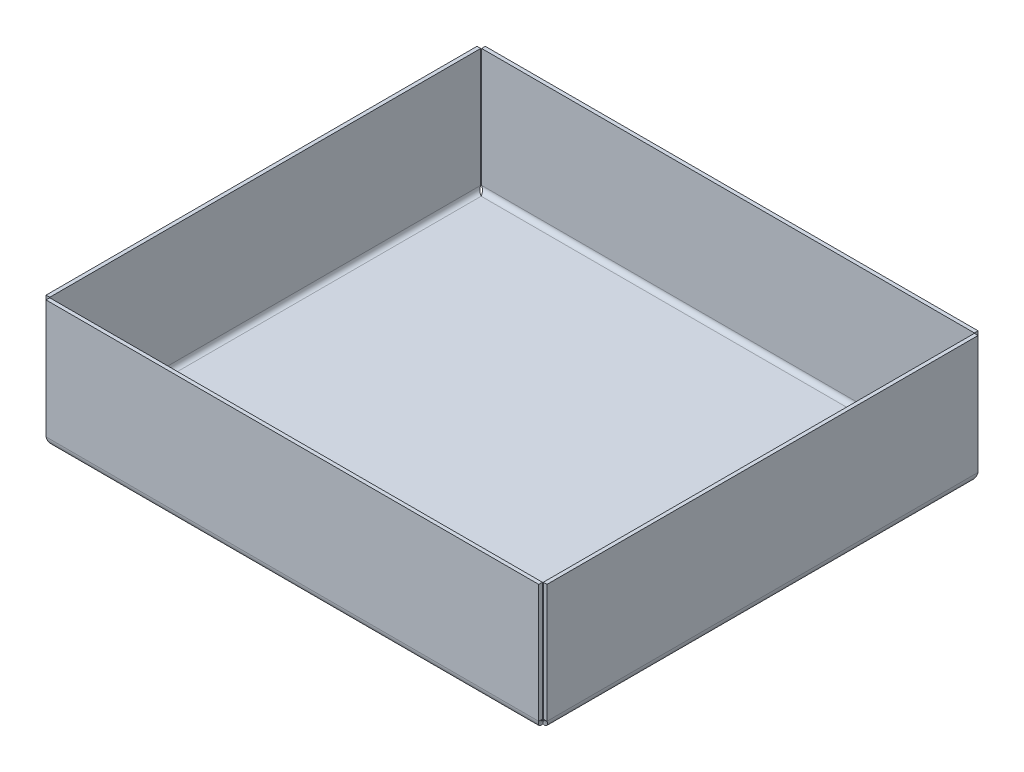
ISO-10303-21;
HEADER;
FILE_DESCRIPTION(('STEP AP214'),'2;1');
FILE_NAME('part.step','',(''),(''),'','','');
FILE_SCHEMA(('AUTOMOTIVE_DESIGN { 1 0 10303 214 1 1 1 1 }'));
ENDSEC;
DATA;
#1=APPLICATION_CONTEXT('core data for automotive mechanical design processes');
#2=APPLICATION_PROTOCOL_DEFINITION('international standard','automotive_design',2000,#1);
#3=PRODUCT_CONTEXT('',#1,'mechanical');
#4=PRODUCT('Part','Part','',(#3));
#5=PRODUCT_RELATED_PRODUCT_CATEGORY('part','',(#4));
#6=PRODUCT_DEFINITION_FORMATION('','',#4);
#7=PRODUCT_DEFINITION_CONTEXT('part definition',#1,'design');
#8=PRODUCT_DEFINITION('design','',#6,#7);
#9=PRODUCT_DEFINITION_SHAPE('','',#8);
#10=(LENGTH_UNIT() NAMED_UNIT(*) SI_UNIT(.MILLI.,.METRE.));
#11=(NAMED_UNIT(*) PLANE_ANGLE_UNIT() SI_UNIT($,.RADIAN.));
#12=(NAMED_UNIT(*) SI_UNIT($,.STERADIAN.) SOLID_ANGLE_UNIT());
#13=UNCERTAINTY_MEASURE_WITH_UNIT(LENGTH_MEASURE(1.E-05),#10,'distance_accuracy_value','');
#14=(GEOMETRIC_REPRESENTATION_CONTEXT(3) GLOBAL_UNCERTAINTY_ASSIGNED_CONTEXT((#13)) GLOBAL_UNIT_ASSIGNED_CONTEXT((#10,
#11,#12)) REPRESENTATION_CONTEXT('',''));
#15=CARTESIAN_POINT('',(0.,0.,0.));
#16=DIRECTION('',(0.,0.,1.));
#17=DIRECTION('',(1.,0.,0.));
#18=AXIS2_PLACEMENT_3D('',#15,#16,#17);
#19=CARTESIAN_POINT('',(0.,1.524,-177.8));
#20=DIRECTION('',(0.,-1.,0.));
#21=DIRECTION('',(0.,0.,-1.));
#22=AXIS2_PLACEMENT_3D('',#19,#20,#21);
#23=PLANE('',#22);
#24=DIRECTION('',(1.,0.,0.));
#25=VECTOR('',#24,1.);
#26=CARTESIAN_POINT('',(203.020394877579,1.52399999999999,-1.9812));
#27=LINE('',#26,#25);
#28=CARTESIAN_POINT('',(201.2188,1.52399999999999,-1.9812));
#29=VERTEX_POINT('',#28);
#30=CARTESIAN_POINT('',(1.98119999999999,1.52399999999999,-1.9812));
#31=VERTEX_POINT('',#30);
#32=EDGE_CURVE('E225',#29,#31,#27,.F.);
#33=ORIENTED_EDGE('',*,*,#32,.F.);
#34=DIRECTION('',(0.,0.,-1.));
#35=VECTOR('',#34,1.);
#36=CARTESIAN_POINT('',(201.2188,1.524,-177.620394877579));
#37=LINE('',#36,#35);
#38=CARTESIAN_POINT('',(201.2188,1.524,-175.8188));
#39=VERTEX_POINT('',#38);
#40=EDGE_CURVE('E357',#39,#29,#37,.F.);
#41=ORIENTED_EDGE('',*,*,#40,.F.);
#42=DIRECTION('',(-1.,0.,0.));
#43=VECTOR('',#42,1.);
#44=CARTESIAN_POINT('',(0.179605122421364,1.52399999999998,-175.8188));
#45=LINE('',#44,#43);
#46=CARTESIAN_POINT('',(1.98119999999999,1.52399999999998,-175.8188));
#47=VERTEX_POINT('',#46);
#48=EDGE_CURVE('E390',#47,#39,#45,.F.);
#49=ORIENTED_EDGE('',*,*,#48,.F.);
#50=DIRECTION('',(0.,0.,1.));
#51=VECTOR('',#50,1.);
#52=CARTESIAN_POINT('',(1.98119999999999,1.524,-0.179605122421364));
#53=LINE('',#52,#51);
#54=EDGE_CURVE('E529',#31,#47,#53,.F.);
#55=ORIENTED_EDGE('',*,*,#54,.F.);
#56=EDGE_LOOP('',(#33,#41,#49,#55));
#57=FACE_BOUND('',#56,.T.);
#58=ADVANCED_FACE('F33',(#57),#23,.F.);
#59=CARTESIAN_POINT('',(0.,0.,-177.8));
#60=DIRECTION('',(0.,-1.,0.));
#61=DIRECTION('',(0.,0.,-1.));
#62=AXIS2_PLACEMENT_3D('',#59,#60,#61);
#63=PLANE('',#62);
#64=DIRECTION('',(0.,0.,-1.));
#65=VECTOR('',#64,1.);
#66=CARTESIAN_POINT('',(201.2188,0.,-177.620394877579));
#67=LINE('',#66,#65);
#68=CARTESIAN_POINT('',(201.2188,0.,-175.8188));
#69=VERTEX_POINT('',#68);
#70=CARTESIAN_POINT('',(201.2188,0.,-1.9812));
#71=VERTEX_POINT('',#70);
#72=EDGE_CURVE('E328',#69,#71,#67,.F.);
#73=ORIENTED_EDGE('',*,*,#72,.T.);
#74=DIRECTION('',(1.,0.,0.));
#75=VECTOR('',#74,1.);
#76=CARTESIAN_POINT('',(203.020394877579,0.,-1.9812));
#77=LINE('',#76,#75);
#78=CARTESIAN_POINT('',(1.98119999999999,0.,-1.98119999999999));
#79=VERTEX_POINT('',#78);
#80=EDGE_CURVE('E228',#71,#79,#77,.F.);
#81=ORIENTED_EDGE('',*,*,#80,.T.);
#82=DIRECTION('',(0.,0.,1.));
#83=VECTOR('',#82,1.);
#84=CARTESIAN_POINT('',(1.98119999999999,0.,-0.179605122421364));
#85=LINE('',#84,#83);
#86=CARTESIAN_POINT('',(1.98119999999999,0.,-175.8188));
#87=VERTEX_POINT('',#86);
#88=EDGE_CURVE('E498',#79,#87,#85,.F.);
#89=ORIENTED_EDGE('',*,*,#88,.T.);
#90=DIRECTION('',(-1.,0.,0.));
#91=VECTOR('',#90,1.);
#92=CARTESIAN_POINT('',(0.179605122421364,0.,-175.8188));
#93=LINE('',#92,#91);
#94=EDGE_CURVE('E394',#87,#69,#93,.F.);
#95=ORIENTED_EDGE('',*,*,#94,.T.);
#96=EDGE_LOOP('',(#73,#81,#89,#95));
#97=FACE_BOUND('',#96,.T.);
#98=ADVANCED_FACE('F35',(#97),#63,.T.);
#99=CARTESIAN_POINT('',(1.98119999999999,-0.0152399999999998,-175.8188));
#100=CARTESIAN_POINT('',(1.5203003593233,-0.0152399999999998,-175.96895739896));
#101=CARTESIAN_POINT('',(1.05973227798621,0.0763876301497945,-176.11906581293));
#102=CARTESIAN_POINT('',(0.208239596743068,0.429087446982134,-176.41933162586));
#103=CARTESIAN_POINT('',(-0.182274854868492,0.690020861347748,-176.569464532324));
#104=CARTESIAN_POINT('',(-0.833979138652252,1.3417251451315,-176.869730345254));
#105=CARTESIAN_POINT('',(-1.09491255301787,1.73223959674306,-177.019863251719));
#106=CARTESIAN_POINT('',(-1.44761236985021,2.58373227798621,-177.320129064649));
#107=CARTESIAN_POINT('',(-1.53924000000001,3.0443003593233,-177.470237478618));
#108=CARTESIAN_POINT('',(-1.53924000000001,3.50519999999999,-177.620394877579));
#109=CARTESIAN_POINT('',(1.98119999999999,0.,-175.8188));
#110=CARTESIAN_POINT('',(1.52229566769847,0.,-175.968957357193));
#111=CARTESIAN_POINT('',(1.06372131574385,0.0912309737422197,-176.11906581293));
#112=CARTESIAN_POINT('',(0.215914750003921,0.442403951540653,-176.41933162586));
#113=CARTESIAN_POINT('',(-0.172909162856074,0.702207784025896,-176.569464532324));
#114=CARTESIAN_POINT('',(-0.821792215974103,1.35109083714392,-176.869730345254));
#115=CARTESIAN_POINT('',(-1.08159604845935,1.73991475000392,-177.019863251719));
#116=CARTESIAN_POINT('',(-1.43276902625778,2.58772131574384,-177.320129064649));
#117=CARTESIAN_POINT('',(-1.52400000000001,3.04629566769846,-177.470237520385));
#118=CARTESIAN_POINT('',(-1.52400000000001,3.50519999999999,-177.620394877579));
#119=CARTESIAN_POINT('',(1.98119999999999,1.524,-175.8188));
#120=CARTESIAN_POINT('',(1.72182650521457,1.524,-175.968953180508));
#121=CARTESIAN_POINT('',(1.46262509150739,1.57556533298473,-176.11906581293));
#122=CARTESIAN_POINT('',(0.983430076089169,1.77405440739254,-176.41933162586));
#123=CARTESIAN_POINT('',(0.763660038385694,1.92090005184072,-176.569464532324));
#124=CARTESIAN_POINT('',(0.396900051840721,2.2876600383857,-176.869730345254));
#125=CARTESIAN_POINT('',(0.25005440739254,2.50743007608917,-177.019863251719));
#126=CARTESIAN_POINT('',(0.0515653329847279,2.98662509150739,-177.320129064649));
#127=CARTESIAN_POINT('',(0.,3.24582650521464,-177.470241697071));
#128=CARTESIAN_POINT('',(0.,3.50519999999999,-177.620394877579));
#129=CARTESIAN_POINT('',(1.98119999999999,1.5393924,-175.8188));
#130=CARTESIAN_POINT('',(1.72384176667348,1.5393924,-175.968953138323));
#131=CARTESIAN_POINT('',(1.4666540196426,1.59055711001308,-176.11906581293));
#132=CARTESIAN_POINT('',(0.99118198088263,1.78750407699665,-176.41933162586));
#133=CARTESIAN_POINT('',(0.773119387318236,1.93320884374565,-176.569464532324));
#134=CARTESIAN_POINT('',(0.409208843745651,2.29711938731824,-176.869730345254));
#135=CARTESIAN_POINT('',(0.263504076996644,2.51518198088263,-177.019863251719));
#136=CARTESIAN_POINT('',(0.0665571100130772,2.9906540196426,-177.320129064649));
#137=CARTESIAN_POINT('',(0.015392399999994,3.24784176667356,-177.470241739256));
#138=CARTESIAN_POINT('',(0.0153923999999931,3.50519999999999,-177.620394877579));
#139=B_SPLINE_SURFACE_WITH_KNOTS('',1,3,((#99,#100,#101,#102,#103,#104,#105,#106,#107,#108),
(#109,#110,#111,#112,#113,#114,#115,#116,#117,#118),(#119,#120,#121,#122,#123,#124,#125,#126,
#127,#128),(#129,#130,#131,#132,#133,#134,#135,#136,#137,#138)),.UNSPECIFIED.,.F.,.F.,.F.,(2,1,
1,2),(4,2,2,2,4),(-0.01,0.,1.,1.0101),(0.,0.25,0.5,0.75,1.),.UNSPECIFIED.);
#140=DIRECTION('',(1.,0.,0.));
#141=VECTOR('',#140,1.);
#142=CARTESIAN_POINT('',(0.,3.50519999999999,-177.620394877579));
#143=LINE('',#142,#141);
#144=CARTESIAN_POINT('',(-1.52400000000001,3.50519999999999,-177.620394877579));
#145=VERTEX_POINT('',#144);
#146=CARTESIAN_POINT('',(0.,3.50519999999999,-177.620394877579));
#147=VERTEX_POINT('',#146);
#148=EDGE_CURVE('E69',#145,#147,#143,.T.);
#149=CARTESIAN_POINT('',(1.98119999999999,1.524,-175.8188));
#150=CARTESIAN_POINT('',(1.92437442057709,1.52399827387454,-175.851698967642));
#151=CARTESIAN_POINT('',(1.86756766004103,1.52644589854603,-175.884585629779));
#152=CARTESIAN_POINT('',(1.75438049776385,1.53620711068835,-175.950353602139));
#153=CARTESIAN_POINT('',(1.69800004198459,1.54352007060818,-175.983234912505));
#154=CARTESIAN_POINT('',(1.53011500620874,1.57269907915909,-176.08187951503));
#155=CARTESIAN_POINT('',(1.4198091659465,1.60180532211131,-176.147676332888));
#156=CARTESIAN_POINT('',(1.19153279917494,1.68361327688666,-176.288059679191));
#157=CARTESIAN_POINT('',(1.07450427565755,1.73894576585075,-176.36264725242));
#158=CARTESIAN_POINT('',(0.853409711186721,1.87123653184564,-176.511803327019));
#159=CARTESIAN_POINT('',(0.74934172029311,1.94819155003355,-176.586371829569));
#160=CARTESIAN_POINT('',(0.558095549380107,2.1208164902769,-176.735518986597));
#161=CARTESIAN_POINT('',(0.470917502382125,2.21648655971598,-176.810097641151));
#162=CARTESIAN_POINT('',(0.316708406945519,2.42295935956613,-176.959284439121));
#163=CARTESIAN_POINT('',(0.24969018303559,2.53377165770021,-177.033892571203));
#164=CARTESIAN_POINT('',(0.138369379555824,2.76645169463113,-177.183218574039));
#165=CARTESIAN_POINT('',(0.0940851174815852,2.88832825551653,-177.257936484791));
#166=CARTESIAN_POINT('',(0.046064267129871,3.07558382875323,-177.369845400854));
#167=CARTESIAN_POINT('',(0.0331270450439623,3.13870528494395,-177.407099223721));
#168=CARTESIAN_POINT('',(0.013455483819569,3.2658999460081,-177.481606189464));
#169=CARTESIAN_POINT('',(0.00671845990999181,3.3299727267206,-177.518859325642));
#170=CARTESIAN_POINT('',(0.00103580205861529,3.43117276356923,-177.577538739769));
#171=CARTESIAN_POINT('',(-3.43849952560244E-06,3.4681901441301,-177.598969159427));
#172=CARTESIAN_POINT('',(0.,3.50519999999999,-177.620394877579));
#173=B_SPLINE_CURVE_WITH_KNOTS('',3,(#149,#150,#151,#152,#153,#154,#155,#156,#157,#158,#159,
#160,#161,#162,#163,#164,#165,#166,#167,#168,#169,#170,#171,#172),.UNSPECIFIED.,.F.,.F.,(4,2,2,
2,2,2,2,2,2,2,2,4),(0.,0.196895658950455,0.393765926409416,0.787309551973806,1.23337933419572,
1.67938192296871,2.12538802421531,2.57167725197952,3.01832550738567,3.24139583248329,
3.46436951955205,3.59267203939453),.UNSPECIFIED.);
#174=EDGE_CURVE('E499',#47,#147,#173,.T.);
#175=DIRECTION('',(0.,-1.,0.));
#176=VECTOR('',#175,1.);
#177=CARTESIAN_POINT('',(1.98119999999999,1.524,-175.8188));
#178=LINE('',#177,#176);
#179=EDGE_CURVE('E11',#47,#87,#178,.T.);
#180=CARTESIAN_POINT('',(1.98119999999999,0.,-175.8188));
#181=CARTESIAN_POINT('',(1.87745593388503,-1.29851588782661E-05,-175.85274739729));
#182=CARTESIAN_POINT('',(1.77371357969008,0.00460525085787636,-175.886694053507));
#183=CARTESIAN_POINT('',(1.56705020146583,0.0230104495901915,-175.954584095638));
#184=CARTESIAN_POINT('',(1.46412913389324,0.0367969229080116,-175.98852748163));
#185=CARTESIAN_POINT('',(1.2599955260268,0.0734304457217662,-176.056386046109));
#186=CARTESIAN_POINT('',(1.15878170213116,0.0962703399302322,-176.090301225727));
#187=CARTESIAN_POINT('',(0.958777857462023,0.150826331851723,-176.158134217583));
#188=CARTESIAN_POINT('',(0.859987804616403,0.18254231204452,-176.192052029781));
#189=CARTESIAN_POINT('',(0.665548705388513,0.254623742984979,-176.259907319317));
#190=CARTESIAN_POINT('',(0.569901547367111,0.294994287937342,-176.293844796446));
#191=CARTESIAN_POINT('',(0.382528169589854,0.384071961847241,-176.361732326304));
#192=CARTESIAN_POINT('',(0.290803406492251,0.432782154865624,-176.395682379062));
#193=CARTESIAN_POINT('',(0.112088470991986,0.538113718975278,-176.463558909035));
#194=CARTESIAN_POINT('',(0.0250954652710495,0.594730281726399,-176.497485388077));
#195=CARTESIAN_POINT('',(-0.143559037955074,0.715471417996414,-176.56535223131));
#196=CARTESIAN_POINT('',(-0.22521867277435,0.77959859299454,-176.599292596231));
#197=CARTESIAN_POINT('',(-0.382511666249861,0.91482390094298,-176.667166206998));
#198=CARTESIAN_POINT('',(-0.458146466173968,0.985920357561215,-176.701099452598));
#199=CARTESIAN_POINT('',(-0.602816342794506,1.13453749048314,-176.768966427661));
#200=CARTESIAN_POINT('',(-0.671851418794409,1.21205816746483,-176.802900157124));
#201=CARTESIAN_POINT('',(-0.802815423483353,1.37295910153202,-176.870783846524));
#202=CARTESIAN_POINT('',(-0.864740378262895,1.45634259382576,-176.904733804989));
#203=CARTESIAN_POINT('',(-0.98093086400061,1.62824327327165,-176.972621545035));
#204=CARTESIAN_POINT('',(-1.03519904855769,1.71675866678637,-177.006559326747));
#205=CARTESIAN_POINT('',(-1.13571283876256,1.89832198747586,-177.074464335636));
#206=CARTESIAN_POINT('',(-1.18195216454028,1.99137339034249,-177.108431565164));
#207=CARTESIAN_POINT('',(-1.26597686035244,2.18117707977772,-177.176352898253));
#208=CARTESIAN_POINT('',(-1.30376535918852,2.27792798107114,-177.21030700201));
#209=CARTESIAN_POINT('',(-1.37058423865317,2.47431725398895,-177.27818601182));
#210=CARTESIAN_POINT('',(-1.3996218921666,2.57395315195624,-177.312110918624));
#211=CARTESIAN_POINT('',(-1.448743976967,2.77536995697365,-177.379945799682));
#212=CARTESIAN_POINT('',(-1.46883205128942,2.87714997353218,-177.413855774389));
#213=CARTESIAN_POINT('',(-1.49756798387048,3.06662797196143,-177.476561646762));
#214=CARTESIAN_POINT('',(-1.50748392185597,3.15413587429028,-177.505357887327));
#215=CARTESIAN_POINT('',(-1.52069701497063,3.32949442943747,-177.56290047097));
#216=CARTESIAN_POINT('',(-1.52400580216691,3.41734420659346,-177.591646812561));
#217=CARTESIAN_POINT('',(-1.52400000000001,3.50519999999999,-177.620394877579));
#218=B_SPLINE_CURVE_WITH_KNOTS('',3,(#180,#181,#182,#183,#184,#185,#186,#187,#188,#189,#190,
#191,#192,#193,#194,#195,#196,#197,#198,#199,#200,#201,#202,#203,#204,#205,#206,#207,#208,#209,
#210,#211,#212,#213,#214,#215,#216,#217),.UNSPECIFIED.,.F.,.F.,(4,2,2,2,2,2,2,2,2,2,2,2,2,2,2,2,
2,2,4),(0.,0.327370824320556,0.65472417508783,0.981819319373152,1.30891013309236,
1.63619400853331,1.96359839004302,2.29080451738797,2.61812431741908,2.94536557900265,
3.27260687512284,3.60003018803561,3.92733974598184,4.25490417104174,4.58234711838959,
4.90951717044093,5.23655392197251,5.51429110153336,5.79153888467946),.UNSPECIFIED.);
#219=EDGE_CURVE('E487',#87,#145,#218,.T.);
#220=ORIENTED_EDGE('',*,*,#148,.T.);
#221=ORIENTED_EDGE('',*,*,#174,.F.);
#222=ORIENTED_EDGE('',*,*,#179,.T.);
#223=ORIENTED_EDGE('',*,*,#219,.T.);
#224=EDGE_LOOP('',(#220,#221,#222,#223));
#225=FACE_BOUND('',#224,.T.);
#226=ADVANCED_FACE('F482',(#225),#139,.F.);
#227=CARTESIAN_POINT('',(-1.53924000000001,3.50519999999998,-0.179605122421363));
#228=CARTESIAN_POINT('',(-1.53924,3.04430035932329,-0.329762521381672));
#229=CARTESIAN_POINT('',(-1.44761236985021,2.5837322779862,-0.479870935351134));
#230=CARTESIAN_POINT('',(-1.09491255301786,1.73223959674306,-0.780136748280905));
#231=CARTESIAN_POINT('',(-0.83397913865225,1.3417251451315,-0.93026965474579));
#232=CARTESIAN_POINT('',(-0.18227485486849,0.690020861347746,-1.23053546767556));
#233=CARTESIAN_POINT('',(0.20823959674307,0.429087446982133,-1.38066837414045));
#234=CARTESIAN_POINT('',(1.05973227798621,0.0763876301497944,-1.68093418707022));
#235=CARTESIAN_POINT('',(1.5203003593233,-0.0152399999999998,-1.83104260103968));
#236=CARTESIAN_POINT('',(1.98119999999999,-0.0152399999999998,-1.98119999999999));
#237=CARTESIAN_POINT('',(-1.52400000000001,3.50519999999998,-0.179605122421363));
#238=CARTESIAN_POINT('',(-1.524,3.04629566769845,-0.329762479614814));
#239=CARTESIAN_POINT('',(-1.43276902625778,2.58772131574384,-0.479870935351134));
#240=CARTESIAN_POINT('',(-1.08159604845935,1.73991475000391,-0.780136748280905));
#241=CARTESIAN_POINT('',(-0.821792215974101,1.35109083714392,-0.93026965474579));
#242=CARTESIAN_POINT('',(-0.172909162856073,0.702207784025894,-1.23053546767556));
#243=CARTESIAN_POINT('',(0.215914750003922,0.442403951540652,-1.38066837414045));
#244=CARTESIAN_POINT('',(1.06372131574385,0.0912309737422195,-1.68093418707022));
#245=CARTESIAN_POINT('',(1.52229566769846,0.,-1.83104264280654));
#246=CARTESIAN_POINT('',(1.98119999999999,0.,-1.98119999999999));
#247=CARTESIAN_POINT('',(0.,3.50519999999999,-0.179605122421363));
#248=CARTESIAN_POINT('',(0.,3.24582650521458,-0.329758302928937));
#249=CARTESIAN_POINT('',(0.0515653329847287,2.98662509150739,-0.479870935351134));
#250=CARTESIAN_POINT('',(0.250054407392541,2.50743007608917,-0.780136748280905));
#251=CARTESIAN_POINT('',(0.396900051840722,2.28766003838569,-0.93026965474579));
#252=CARTESIAN_POINT('',(0.763660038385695,1.92090005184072,-1.23053546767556));
#253=CARTESIAN_POINT('',(0.98343007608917,1.77405440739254,-1.38066837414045));
#254=CARTESIAN_POINT('',(1.46262509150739,1.57556533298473,-1.68093418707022));
#255=CARTESIAN_POINT('',(1.72182650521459,1.524,-1.83104681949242));
#256=CARTESIAN_POINT('',(1.98119999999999,1.524,-1.98119999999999));
#257=CARTESIAN_POINT('',(0.0153923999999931,3.50519999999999,-0.179605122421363));
#258=CARTESIAN_POINT('',(0.0153923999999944,3.2478417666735,-0.329758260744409));
#259=CARTESIAN_POINT('',(0.0665571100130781,2.9906540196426,-0.479870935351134));
#260=CARTESIAN_POINT('',(0.263504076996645,2.51518198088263,-0.780136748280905));
#261=CARTESIAN_POINT('',(0.409208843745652,2.29711938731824,-0.93026965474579));
#262=CARTESIAN_POINT('',(0.773119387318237,1.93320884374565,-1.23053546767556));
#263=CARTESIAN_POINT('',(0.991181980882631,1.78750407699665,-1.38066837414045));
#264=CARTESIAN_POINT('',(1.4666540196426,1.59055711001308,-1.68093418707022));
#265=CARTESIAN_POINT('',(1.7238417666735,1.5393924,-1.83104686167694));
#266=CARTESIAN_POINT('',(1.98119999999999,1.5393924,-1.98119999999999));
#267=B_SPLINE_SURFACE_WITH_KNOTS('',1,3,((#227,#228,#229,#230,#231,#232,#233,#234,#235,#236),
(#237,#238,#239,#240,#241,#242,#243,#244,#245,#246),(#247,#248,#249,#250,#251,#252,#253,#254,
#255,#256),(#257,#258,#259,#260,#261,#262,#263,#264,#265,#266)),.UNSPECIFIED.,.F.,.F.,.F.,(2,1,
1,2),(4,2,2,2,4),(-0.01,0.,1.,1.0101),(0.,0.25,0.5,0.75,1.),.UNSPECIFIED.);
#268=CARTESIAN_POINT('',(0.,3.50519999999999,-0.179605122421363));
#269=CARTESIAN_POINT('',(-1.72612546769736E-06,3.44837442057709,-0.212504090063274));
#270=CARTESIAN_POINT('',(0.00244589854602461,3.39156766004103,-0.245390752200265));
#271=CARTESIAN_POINT('',(0.012207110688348,3.27838049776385,-0.311158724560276));
#272=CARTESIAN_POINT('',(0.0195200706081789,3.22200004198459,-0.344040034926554));
#273=CARTESIAN_POINT('',(0.0486990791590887,3.05411500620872,-0.442684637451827));
#274=CARTESIAN_POINT('',(0.077805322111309,2.94380916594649,-0.508481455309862));
#275=CARTESIAN_POINT('',(0.159613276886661,2.71553279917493,-0.648864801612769));
#276=CARTESIAN_POINT('',(0.214945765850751,2.59850427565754,-0.72345237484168));
#277=CARTESIAN_POINT('',(0.347236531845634,2.37740971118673,-0.872608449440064));
#278=CARTESIAN_POINT('',(0.424191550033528,2.27334172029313,-0.947176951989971));
#279=CARTESIAN_POINT('',(0.596816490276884,2.08209554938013,-1.09632410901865));
#280=CARTESIAN_POINT('',(0.692486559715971,1.99491750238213,-1.17090276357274));
#281=CARTESIAN_POINT('',(0.898959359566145,1.84070840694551,-1.3200895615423));
#282=CARTESIAN_POINT('',(1.00977165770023,1.77369018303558,-1.39469769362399));
#283=CARTESIAN_POINT('',(1.24245169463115,1.66236937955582,-1.54402369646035));
#284=CARTESIAN_POINT('',(1.36432825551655,1.61808511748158,-1.61874160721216));
#285=CARTESIAN_POINT('',(1.55158382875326,1.57006426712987,-1.73065052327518));
#286=CARTESIAN_POINT('',(1.61470528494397,1.55712704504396,-1.76790434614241));
#287=CARTESIAN_POINT('',(1.74189994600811,1.53745548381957,-1.84241131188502));
#288=CARTESIAN_POINT('',(1.80597272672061,1.53071845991,-1.87966444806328));
#289=CARTESIAN_POINT('',(1.90717276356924,1.52503580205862,-1.93834386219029));
#290=CARTESIAN_POINT('',(1.94419014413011,1.52399656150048,-1.95977428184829));
#291=CARTESIAN_POINT('',(1.98119999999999,1.524,-1.98119999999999));
#292=B_SPLINE_CURVE_WITH_KNOTS('',3,(#268,#269,#270,#271,#272,#273,#274,#275,#276,#277,#278,
#279,#280,#281,#282,#283,#284,#285,#286,#287,#288,#289,#290,#291),.UNSPECIFIED.,.F.,.F.,(4,2,2,
2,2,2,2,2,2,2,2,4),(0.,0.196895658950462,0.393765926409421,0.787309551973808,1.23337933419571,
1.67938192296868,2.12538802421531,2.57167725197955,3.01832550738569,3.2413958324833,
3.46436951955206,3.59267203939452),.UNSPECIFIED.);
#293=CARTESIAN_POINT('',(0.,3.50519999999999,-0.179605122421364));
#294=VERTEX_POINT('',#293);
#295=EDGE_CURVE('E37',#294,#31,#292,.T.);
#296=DIRECTION('',(1.,0.,0.));
#297=VECTOR('',#296,1.);
#298=CARTESIAN_POINT('',(0.,3.50519999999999,-0.17960512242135));
#299=LINE('',#298,#297);
#300=CARTESIAN_POINT('',(-1.52400000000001,3.50519999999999,-0.17960512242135));
#301=VERTEX_POINT('',#300);
#302=EDGE_CURVE('E543',#301,#294,#299,.T.);
#303=CARTESIAN_POINT('',(-1.52400000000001,3.50519999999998,-0.179605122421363));
#304=CARTESIAN_POINT('',(-1.52401298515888,3.40145593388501,-0.213552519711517));
#305=CARTESIAN_POINT('',(-1.51939474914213,3.29771357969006,-0.247499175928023));
#306=CARTESIAN_POINT('',(-1.50098955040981,3.09105020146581,-0.315389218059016));
#307=CARTESIAN_POINT('',(-1.48720307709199,2.98812913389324,-0.349332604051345));
#308=CARTESIAN_POINT('',(-1.45056955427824,2.7839955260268,-0.417191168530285));
#309=CARTESIAN_POINT('',(-1.42772966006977,2.68278170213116,-0.45110634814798));
#310=CARTESIAN_POINT('',(-1.37317366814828,2.48277785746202,-0.518939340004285));
#311=CARTESIAN_POINT('',(-1.34145768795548,2.3839878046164,-0.552857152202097));
#312=CARTESIAN_POINT('',(-1.26937625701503,2.18954870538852,-0.620712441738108));
#313=CARTESIAN_POINT('',(-1.22900571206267,2.09390154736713,-0.654649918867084));
#314=CARTESIAN_POINT('',(-1.13992803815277,1.90652816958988,-0.722537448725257));
#315=CARTESIAN_POINT('',(-1.09121784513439,1.81480340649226,-0.756487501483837));
#316=CARTESIAN_POINT('',(-0.985886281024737,1.636088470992,-0.824364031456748));
#317=CARTESIAN_POINT('',(-0.929269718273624,1.54909546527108,-0.858290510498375));
#318=CARTESIAN_POINT('',(-0.808528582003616,1.38044096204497,-0.926157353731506));
#319=CARTESIAN_POINT('',(-0.744401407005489,1.29878132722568,-0.960097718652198));
#320=CARTESIAN_POINT('',(-0.609176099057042,1.14148833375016,-1.02797132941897));
#321=CARTESIAN_POINT('',(-0.538079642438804,1.06585353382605,-1.06190457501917));
#322=CARTESIAN_POINT('',(-0.389462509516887,0.921183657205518,-1.12977155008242));
#323=CARTESIAN_POINT('',(-0.311941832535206,0.852148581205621,-1.16370527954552));
#324=CARTESIAN_POINT('',(-0.151040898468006,0.721184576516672,-1.23158896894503));
#325=CARTESIAN_POINT('',(-0.067657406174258,0.659259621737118,-1.2655389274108));
#326=CARTESIAN_POINT('',(0.104243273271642,0.543069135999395,-1.33342666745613));
#327=CARTESIAN_POINT('',(0.192758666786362,0.488800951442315,-1.36736444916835));
#328=CARTESIAN_POINT('',(0.374321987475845,0.388287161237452,-1.43526945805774));
#329=CARTESIAN_POINT('',(0.467373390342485,0.342047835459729,-1.46923668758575));
#330=CARTESIAN_POINT('',(0.657177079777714,0.258023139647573,-1.53715802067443));
#331=CARTESIAN_POINT('',(0.753927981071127,0.220234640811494,-1.57111212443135));
#332=CARTESIAN_POINT('',(0.950317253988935,0.153415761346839,-1.63899113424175));
#333=CARTESIAN_POINT('',(1.04995315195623,0.124378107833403,-1.67291604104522));
#334=CARTESIAN_POINT('',(1.25136995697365,0.0752560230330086,-1.74075092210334));
#335=CARTESIAN_POINT('',(1.35314997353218,0.055167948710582,-1.77466089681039));
#336=CARTESIAN_POINT('',(1.54262797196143,0.0264320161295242,-1.83736676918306));
#337=CARTESIAN_POINT('',(1.63013587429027,0.0165160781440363,-1.86616300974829));
#338=CARTESIAN_POINT('',(1.80549442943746,0.00330298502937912,-1.92370559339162));
#339=CARTESIAN_POINT('',(1.89334420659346,-5.80216690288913E-06,-1.95245193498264));
#340=CARTESIAN_POINT('',(1.98119999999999,0.,-1.98119999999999));
#341=B_SPLINE_CURVE_WITH_KNOTS('',3,(#303,#304,#305,#306,#307,#308,#309,#310,#311,#312,#313,
#314,#315,#316,#317,#318,#319,#320,#321,#322,#323,#324,#325,#326,#327,#328,#329,#330,#331,#332,
#333,#334,#335,#336,#337,#338,#339,#340),.UNSPECIFIED.,.F.,.F.,(4,2,2,2,2,2,2,2,2,2,2,2,2,2,2,2,
2,2,4),(0.,0.327370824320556,0.654724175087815,0.981819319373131,1.30891013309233,
1.63619400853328,1.96359839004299,2.29080451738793,2.61812431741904,2.94536557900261,
3.27260687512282,3.60003018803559,3.92733974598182,4.25490417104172,4.58234711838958,
4.90951717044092,5.2365539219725,5.51429110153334,5.79153888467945),.UNSPECIFIED.);
#342=EDGE_CURVE('E493',#301,#79,#341,.T.);
#343=DIRECTION('',(0.,-1.,0.));
#344=VECTOR('',#343,1.);
#345=CARTESIAN_POINT('',(1.98119999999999,1.524,-1.98119999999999));
#346=LINE('',#345,#344);
#347=EDGE_CURVE('E48',#31,#79,#346,.T.);
#348=ORIENTED_EDGE('',*,*,#295,.F.);
#349=ORIENTED_EDGE('',*,*,#302,.F.);
#350=ORIENTED_EDGE('',*,*,#342,.T.);
#351=ORIENTED_EDGE('',*,*,#347,.F.);
#352=EDGE_LOOP('',(#348,#349,#350,#351));
#353=FACE_BOUND('',#352,.T.);
#354=ADVANCED_FACE('F480',(#353),#267,.F.);
#355=CARTESIAN_POINT('',(1.98119999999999,3.5052,-0.179605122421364));
#356=DIRECTION('',(0.,0.,1.));
#357=DIRECTION('',(-1.,0.,0.));
#358=AXIS2_PLACEMENT_3D('',#355,#356,#357);
#359=CYLINDRICAL_SURFACE('',#358,3.5052);
#360=ORIENTED_EDGE('',*,*,#88,.F.);
#361=ORIENTED_EDGE('',*,*,#342,.F.);
#362=DIRECTION('',(0.,0.,-1.));
#363=VECTOR('',#362,1.);
#364=CARTESIAN_POINT('',(-1.52400000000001,3.50519999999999,0.));
#365=LINE('',#364,#363);
#366=EDGE_CURVE('E564',#301,#145,#365,.T.);
#367=ORIENTED_EDGE('',*,*,#366,.T.);
#368=ORIENTED_EDGE('',*,*,#219,.F.);
#369=EDGE_LOOP('',(#360,#361,#367,#368));
#370=FACE_BOUND('',#369,.T.);
#371=ADVANCED_FACE('F477',(#370),#359,.T.);
#372=CARTESIAN_POINT('',(1.98119999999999,3.5052,-0.179605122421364));
#373=DIRECTION('',(0.,0.,1.));
#374=DIRECTION('',(-1.,0.,0.));
#375=AXIS2_PLACEMENT_3D('',#372,#373,#374);
#376=CYLINDRICAL_SURFACE('',#375,1.9812);
#377=ORIENTED_EDGE('',*,*,#54,.T.);
#378=ORIENTED_EDGE('',*,*,#174,.T.);
#379=DIRECTION('',(0.,0.,1.));
#380=VECTOR('',#379,1.);
#381=CARTESIAN_POINT('',(0.,3.50519999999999,-177.8));
#382=LINE('',#381,#380);
#383=EDGE_CURVE('E542',#147,#294,#382,.T.);
#384=ORIENTED_EDGE('',*,*,#383,.T.);
#385=ORIENTED_EDGE('',*,*,#295,.T.);
#386=EDGE_LOOP('',(#377,#378,#384,#385));
#387=FACE_BOUND('',#386,.T.);
#388=ADVANCED_FACE('F466',(#387),#376,.F.);
#389=CARTESIAN_POINT('',(0.,1.524,-177.620394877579));
#390=DIRECTION('',(0.,0.,-1.));
#391=DIRECTION('',(0.,1.,0.));
#392=AXIS2_PLACEMENT_3D('',#389,#390,#391);
#393=PLANE('',#392);
#394=DIRECTION('',(0.,1.,0.));
#395=VECTOR('',#394,1.);
#396=CARTESIAN_POINT('',(-1.524,1.524,-177.620394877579));
#397=LINE('',#396,#395);
#398=CARTESIAN_POINT('',(-1.52400000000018,52.324,-177.620394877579));
#399=VERTEX_POINT('',#398);
#400=EDGE_CURVE('E559',#145,#399,#397,.T.);
#401=ORIENTED_EDGE('',*,*,#400,.T.);
#402=DIRECTION('',(1.,0.,0.));
#403=VECTOR('',#402,1.);
#404=CARTESIAN_POINT('',(-1.52400000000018,52.324,-177.620394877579));
#405=LINE('',#404,#403);
#406=CARTESIAN_POINT('',(-1.77367354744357E-13,52.324,-177.620394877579));
#407=VERTEX_POINT('',#406);
#408=EDGE_CURVE('E565',#399,#407,#405,.T.);
#409=ORIENTED_EDGE('',*,*,#408,.T.);
#410=DIRECTION('',(0.,1.,0.));
#411=VECTOR('',#410,1.);
#412=CARTESIAN_POINT('',(0.,1.524,-177.620394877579));
#413=LINE('',#412,#411);
#414=EDGE_CURVE('E562',#147,#407,#413,.T.);
#415=ORIENTED_EDGE('',*,*,#414,.F.);
#416=ORIENTED_EDGE('',*,*,#148,.F.);
#417=EDGE_LOOP('',(#401,#409,#415,#416));
#418=FACE_BOUND('',#417,.T.);
#419=ADVANCED_FACE('F462',(#418),#393,.T.);
#420=CARTESIAN_POINT('',(-1.524,1.52399999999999,0.));
#421=DIRECTION('',(1.,0.,0.));
#422=DIRECTION('',(0.,1.,0.));
#423=AXIS2_PLACEMENT_3D('',#420,#421,#422);
#424=PLANE('',#423);
#425=ORIENTED_EDGE('',*,*,#366,.F.);
#426=DIRECTION('',(0.,1.,0.));
#427=VECTOR('',#426,1.);
#428=CARTESIAN_POINT('',(-1.524,1.52399999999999,-0.179605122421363));
#429=LINE('',#428,#427);
#430=CARTESIAN_POINT('',(-1.52400000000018,52.324,-0.17960512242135));
#431=VERTEX_POINT('',#430);
#432=EDGE_CURVE('E574',#301,#431,#429,.T.);
#433=ORIENTED_EDGE('',*,*,#432,.T.);
#434=DIRECTION('',(0.,0.,-1.));
#435=VECTOR('',#434,1.);
#436=CARTESIAN_POINT('',(-1.52400000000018,52.324,-177.8));
#437=LINE('',#436,#435);
#438=EDGE_CURVE('E549',#431,#399,#437,.T.);
#439=ORIENTED_EDGE('',*,*,#438,.T.);
#440=ORIENTED_EDGE('',*,*,#400,.F.);
#441=EDGE_LOOP('',(#425,#433,#439,#440));
#442=FACE_BOUND('',#441,.T.);
#443=ADVANCED_FACE('F465',(#442),#424,.F.);
#444=CARTESIAN_POINT('',(0.,1.524,0.));
#445=DIRECTION('',(1.,0.,0.));
#446=DIRECTION('',(0.,1.,0.));
#447=AXIS2_PLACEMENT_3D('',#444,#445,#446);
#448=PLANE('',#447);
#449=DIRECTION('',(0.,1.,0.));
#450=VECTOR('',#449,1.);
#451=CARTESIAN_POINT('',(0.,1.524,-0.179605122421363));
#452=LINE('',#451,#450);
#453=CARTESIAN_POINT('',(-1.77367354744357E-13,52.324,-0.17960512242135));
#454=VERTEX_POINT('',#453);
#455=EDGE_CURVE('E402',#294,#454,#452,.T.);
#456=ORIENTED_EDGE('',*,*,#455,.F.);
#457=ORIENTED_EDGE('',*,*,#383,.F.);
#458=ORIENTED_EDGE('',*,*,#414,.T.);
#459=DIRECTION('',(0.,0.,-1.));
#460=VECTOR('',#459,1.);
#461=CARTESIAN_POINT('',(-1.77367354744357E-13,52.324,-177.8));
#462=LINE('',#461,#460);
#463=EDGE_CURVE('E573',#454,#407,#462,.T.);
#464=ORIENTED_EDGE('',*,*,#463,.F.);
#465=EDGE_LOOP('',(#456,#457,#458,#464));
#466=FACE_BOUND('',#465,.T.);
#467=ADVANCED_FACE('F470',(#466),#448,.T.);
#468=CARTESIAN_POINT('',(-1.52400000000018,52.324,-177.8));
#469=DIRECTION('',(0.,-1.,0.));
#470=DIRECTION('',(1.,0.,0.));
#471=AXIS2_PLACEMENT_3D('',#468,#469,#470);
#472=PLANE('',#471);
#473=ORIENTED_EDGE('',*,*,#438,.F.);
#474=DIRECTION('',(1.,0.,0.));
#475=VECTOR('',#474,1.);
#476=CARTESIAN_POINT('',(-1.52400000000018,52.324,-0.17960512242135));
#477=LINE('',#476,#475);
#478=EDGE_CURVE('E78',#431,#454,#477,.T.);
#479=ORIENTED_EDGE('',*,*,#478,.T.);
#480=ORIENTED_EDGE('',*,*,#463,.T.);
#481=ORIENTED_EDGE('',*,*,#408,.F.);
#482=EDGE_LOOP('',(#473,#479,#480,#481));
#483=FACE_BOUND('',#482,.T.);
#484=ADVANCED_FACE('F460',(#483),#472,.F.);
#485=CARTESIAN_POINT('',(0.,1.524,-0.179605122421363));
#486=DIRECTION('',(0.,0.,-1.));
#487=DIRECTION('',(0.,1.,0.));
#488=AXIS2_PLACEMENT_3D('',#485,#486,#487);
#489=PLANE('',#488);
#490=ORIENTED_EDGE('',*,*,#478,.F.);
#491=ORIENTED_EDGE('',*,*,#432,.F.);
#492=ORIENTED_EDGE('',*,*,#302,.T.);
#493=ORIENTED_EDGE('',*,*,#455,.T.);
#494=EDGE_LOOP('',(#490,#491,#492,#493));
#495=FACE_BOUND('',#494,.T.);
#496=ADVANCED_FACE('F451',(#495),#489,.F.);
#497=CARTESIAN_POINT('',(201.2188,-0.0152400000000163,-175.8188));
#498=CARTESIAN_POINT('',(201.36895739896,-0.0152400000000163,-176.279699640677));
#499=CARTESIAN_POINT('',(201.51906581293,0.0763876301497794,-176.740267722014));
#500=CARTESIAN_POINT('',(201.81933162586,0.429087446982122,-177.591760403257));
#501=CARTESIAN_POINT('',(201.969464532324,0.690020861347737,-177.982274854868));
#502=CARTESIAN_POINT('',(202.269730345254,1.3417251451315,-178.633979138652));
#503=CARTESIAN_POINT('',(202.419863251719,1.73223959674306,-178.894912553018));
#504=CARTESIAN_POINT('',(202.720129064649,2.58373227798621,-179.24761236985));
#505=CARTESIAN_POINT('',(202.870237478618,3.04430035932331,-179.33924));
#506=CARTESIAN_POINT('',(203.020394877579,3.5052,-179.33924));
#507=CARTESIAN_POINT('',(201.2188,0.,-175.8188));
#508=CARTESIAN_POINT('',(201.368957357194,0.,-176.277704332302));
#509=CARTESIAN_POINT('',(201.51906581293,0.0912309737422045,-176.736278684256));
#510=CARTESIAN_POINT('',(201.81933162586,0.442403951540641,-177.584085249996));
#511=CARTESIAN_POINT('',(201.969464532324,0.702207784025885,-177.972909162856));
#512=CARTESIAN_POINT('',(202.269730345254,1.35109083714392,-178.621792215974));
#513=CARTESIAN_POINT('',(202.419863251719,1.73991475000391,-178.881596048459));
#514=CARTESIAN_POINT('',(202.720129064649,2.58772131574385,-179.232769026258));
#515=CARTESIAN_POINT('',(202.870237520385,3.04629566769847,-179.324));
#516=CARTESIAN_POINT('',(203.020394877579,3.5052,-179.324));
#517=CARTESIAN_POINT('',(201.2188,1.52399999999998,-175.8188));
#518=CARTESIAN_POINT('',(201.368953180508,1.52399999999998,-176.078173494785));
#519=CARTESIAN_POINT('',(201.51906581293,1.57556533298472,-176.337374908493));
#520=CARTESIAN_POINT('',(201.81933162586,1.77405440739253,-176.816569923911));
#521=CARTESIAN_POINT('',(201.969464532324,1.92090005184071,-177.036339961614));
#522=CARTESIAN_POINT('',(202.269730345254,2.28766003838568,-177.403099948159));
#523=CARTESIAN_POINT('',(202.419863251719,2.50743007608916,-177.549945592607));
#524=CARTESIAN_POINT('',(202.720129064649,2.98662509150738,-177.748434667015));
#525=CARTESIAN_POINT('',(202.870241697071,3.24582650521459,-177.8));
#526=CARTESIAN_POINT('',(203.020394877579,3.50519999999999,-177.8));
#527=CARTESIAN_POINT('',(201.2188,1.53939239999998,-175.8188));
#528=CARTESIAN_POINT('',(201.368953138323,1.53939239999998,-176.076158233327));
#529=CARTESIAN_POINT('',(201.51906581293,1.59055711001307,-176.333345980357));
#530=CARTESIAN_POINT('',(201.81933162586,1.78750407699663,-176.808818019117));
#531=CARTESIAN_POINT('',(201.969464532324,1.93320884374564,-177.026880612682));
#532=CARTESIAN_POINT('',(202.269730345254,2.29711938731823,-177.390791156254));
#533=CARTESIAN_POINT('',(202.419863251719,2.51518198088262,-177.536495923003));
#534=CARTESIAN_POINT('',(202.720129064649,2.99065401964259,-177.733442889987));
#535=CARTESIAN_POINT('',(202.870241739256,3.2478417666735,-177.7846076));
#536=CARTESIAN_POINT('',(203.020394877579,3.50519999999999,-177.7846076));
#537=B_SPLINE_SURFACE_WITH_KNOTS('',1,3,((#497,#498,#499,#500,#501,#502,#503,#504,#505,#506),
(#507,#508,#509,#510,#511,#512,#513,#514,#515,#516),(#517,#518,#519,#520,#521,#522,#523,#524,
#525,#526),(#527,#528,#529,#530,#531,#532,#533,#534,#535,#536)),.UNSPECIFIED.,.F.,.F.,.F.,(2,1,
1,2),(4,2,2,2,4),(-0.01,0.,1.,1.0101),(0.,0.25,0.5,0.75,1.),.UNSPECIFIED.);
#538=DIRECTION('',(0.,0.,1.));
#539=VECTOR('',#538,1.);
#540=CARTESIAN_POINT('',(203.020394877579,3.50519999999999,-177.8));
#541=LINE('',#540,#539);
#542=CARTESIAN_POINT('',(203.020394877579,3.50519999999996,-179.324));
#543=VERTEX_POINT('',#542);
#544=CARTESIAN_POINT('',(203.020394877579,3.50519999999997,-177.8));
#545=VERTEX_POINT('',#544);
#546=EDGE_CURVE('E383',#543,#545,#541,.T.);
#547=CARTESIAN_POINT('',(201.2188,1.52399999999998,-175.8188));
#548=CARTESIAN_POINT('',(201.251698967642,1.52399827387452,-175.875625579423));
#549=CARTESIAN_POINT('',(201.284585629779,1.52644589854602,-175.932432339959));
#550=CARTESIAN_POINT('',(201.350353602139,1.53620711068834,-176.045619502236));
#551=CARTESIAN_POINT('',(201.383234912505,1.54352007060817,-176.101999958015));
#552=CARTESIAN_POINT('',(201.48187951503,1.57269907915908,-176.269884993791));
#553=CARTESIAN_POINT('',(201.547676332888,1.6018053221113,-176.380190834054));
#554=CARTESIAN_POINT('',(201.688059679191,1.68361327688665,-176.608467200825));
#555=CARTESIAN_POINT('',(201.76264725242,1.73894576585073,-176.725495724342));
#556=CARTESIAN_POINT('',(201.911803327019,1.8712365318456,-176.946590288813));
#557=CARTESIAN_POINT('',(201.986371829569,1.9481915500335,-177.050658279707));
#558=CARTESIAN_POINT('',(202.135518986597,2.12081649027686,-177.24190445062));
#559=CARTESIAN_POINT('',(202.210097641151,2.21648655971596,-177.329082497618));
#560=CARTESIAN_POINT('',(202.359284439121,2.42295935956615,-177.483291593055));
#561=CARTESIAN_POINT('',(202.433892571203,2.53377165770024,-177.550309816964));
#562=CARTESIAN_POINT('',(202.583218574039,2.76645169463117,-177.661630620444));
#563=CARTESIAN_POINT('',(202.657936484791,2.88832825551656,-177.705914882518));
#564=CARTESIAN_POINT('',(202.769845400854,3.07558382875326,-177.75393573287));
#565=CARTESIAN_POINT('',(202.807099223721,3.13870528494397,-177.766872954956));
#566=CARTESIAN_POINT('',(202.881606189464,3.26589994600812,-177.78654451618));
#567=CARTESIAN_POINT('',(202.918859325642,3.32997272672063,-177.79328154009));
#568=CARTESIAN_POINT('',(202.977538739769,3.43117276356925,-177.798964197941));
#569=CARTESIAN_POINT('',(202.998969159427,3.46819014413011,-177.8000034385));
#570=CARTESIAN_POINT('',(203.020394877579,3.50519999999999,-177.8));
#571=B_SPLINE_CURVE_WITH_KNOTS('',3,(#547,#548,#549,#550,#551,#552,#553,#554,#555,#556,#557,
#558,#559,#560,#561,#562,#563,#564,#565,#566,#567,#568,#569,#570),.UNSPECIFIED.,.F.,.F.,(4,2,2,
2,2,2,2,2,2,2,2,4),(0.,0.196895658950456,0.393765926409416,0.787309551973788,1.23337933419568,
1.67938192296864,2.12538802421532,2.57167725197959,3.01832550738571,3.24139583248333,
3.46436951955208,3.59267203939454),.UNSPECIFIED.);
#572=EDGE_CURVE('E393',#39,#545,#571,.T.);
#573=DIRECTION('',(0.,-1.,0.));
#574=VECTOR('',#573,1.);
#575=CARTESIAN_POINT('',(201.2188,1.52399999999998,-175.8188));
#576=LINE('',#575,#574);
#577=EDGE_CURVE('E399',#39,#69,#576,.T.);
#578=CARTESIAN_POINT('',(201.2188,0.,-175.8188));
#579=CARTESIAN_POINT('',(201.25274739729,-1.2985158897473E-05,-175.922544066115));
#580=CARTESIAN_POINT('',(201.286694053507,0.00460525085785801,-176.02628642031));
#581=CARTESIAN_POINT('',(201.354584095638,0.0230104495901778,-176.232949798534));
#582=CARTESIAN_POINT('',(201.38852748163,0.0367969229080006,-176.335870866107));
#583=CARTESIAN_POINT('',(201.456386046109,0.0734304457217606,-176.540004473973));
#584=CARTESIAN_POINT('',(201.490301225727,0.0962703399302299,-176.641218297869));
#585=CARTESIAN_POINT('',(201.558134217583,0.150826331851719,-176.841222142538));
#586=CARTESIAN_POINT('',(201.592052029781,0.182542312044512,-176.940012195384));
#587=CARTESIAN_POINT('',(201.659907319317,0.25462374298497,-177.134451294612));
#588=CARTESIAN_POINT('',(201.693844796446,0.294994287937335,-177.230098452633));
#589=CARTESIAN_POINT('',(201.761732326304,0.384071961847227,-177.41747183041));
#590=CARTESIAN_POINT('',(201.795682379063,0.432782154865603,-177.509196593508));
#591=CARTESIAN_POINT('',(201.863558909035,0.538113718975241,-177.687911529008));
#592=CARTESIAN_POINT('',(201.897485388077,0.594730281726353,-177.774904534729));
#593=CARTESIAN_POINT('',(201.96535223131,0.715471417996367,-177.943559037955));
#594=CARTESIAN_POINT('',(201.999292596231,0.7795985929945,-178.025218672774));
#595=CARTESIAN_POINT('',(202.067166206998,0.914823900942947,-178.18251166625));
#596=CARTESIAN_POINT('',(202.101099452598,0.985920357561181,-178.258146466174));
#597=CARTESIAN_POINT('',(202.168966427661,1.1345374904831,-178.402816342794));
#598=CARTESIAN_POINT('',(202.202900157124,1.21205816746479,-178.471851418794));
#599=CARTESIAN_POINT('',(202.270783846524,1.372959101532,-178.602815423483));
#600=CARTESIAN_POINT('',(202.304733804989,1.45634259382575,-178.664740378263));
#601=CARTESIAN_POINT('',(202.372621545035,1.62824327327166,-178.780930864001));
#602=CARTESIAN_POINT('',(202.406559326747,1.71675866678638,-178.835199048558));
#603=CARTESIAN_POINT('',(202.474464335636,1.89832198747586,-178.935712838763));
#604=CARTESIAN_POINT('',(202.508431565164,1.9913733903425,-178.98195216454));
#605=CARTESIAN_POINT('',(202.576352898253,2.18117707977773,-179.065976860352));
#606=CARTESIAN_POINT('',(202.61030700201,2.27792798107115,-179.103765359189));
#607=CARTESIAN_POINT('',(202.67818601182,2.47431725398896,-179.170584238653));
#608=CARTESIAN_POINT('',(202.712110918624,2.57395315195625,-179.199621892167));
#609=CARTESIAN_POINT('',(202.779945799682,2.77536995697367,-179.248743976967));
#610=CARTESIAN_POINT('',(202.813855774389,2.8771499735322,-179.268832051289));
#611=CARTESIAN_POINT('',(202.876561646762,3.06662797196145,-179.29756798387));
#612=CARTESIAN_POINT('',(202.905357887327,3.1541358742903,-179.307483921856));
#613=CARTESIAN_POINT('',(202.96290047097,3.32949442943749,-179.320697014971));
#614=CARTESIAN_POINT('',(202.991646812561,3.41734420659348,-179.324005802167));
#615=CARTESIAN_POINT('',(203.020394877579,3.5052,-179.324));
#616=B_SPLINE_CURVE_WITH_KNOTS('',3,(#578,#579,#580,#581,#582,#583,#584,#585,#586,#587,#588,
#589,#590,#591,#592,#593,#594,#595,#596,#597,#598,#599,#600,#601,#602,#603,#604,#605,#606,#607,
#608,#609,#610,#611,#612,#613,#614,#615),.UNSPECIFIED.,.F.,.F.,(4,2,2,2,2,2,2,2,2,2,2,2,2,2,2,2,
2,2,4),(0.,0.327370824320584,0.654724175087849,0.98181931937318,1.30891013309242,
1.63619400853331,1.963598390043,2.29080451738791,2.61812431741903,2.94536557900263,
3.27260687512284,3.60003018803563,3.92733974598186,4.25490417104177,4.58234711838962,
4.90951717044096,5.23655392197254,5.51429110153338,5.79153888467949),.UNSPECIFIED.);
#617=EDGE_CURVE('E397',#69,#543,#616,.T.);
#618=ORIENTED_EDGE('',*,*,#546,.T.);
#619=ORIENTED_EDGE('',*,*,#572,.F.);
#620=ORIENTED_EDGE('',*,*,#577,.T.);
#621=ORIENTED_EDGE('',*,*,#617,.T.);
#622=EDGE_LOOP('',(#618,#619,#620,#621));
#623=FACE_BOUND('',#622,.T.);
#624=ADVANCED_FACE('F415',(#623),#537,.F.);
#625=CARTESIAN_POINT('',(0.179605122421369,3.50520000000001,-179.33924));
#626=CARTESIAN_POINT('',(0.329762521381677,3.04430035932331,-179.33924));
#627=CARTESIAN_POINT('',(0.479870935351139,2.58373227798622,-179.24761236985));
#628=CARTESIAN_POINT('',(0.780136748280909,1.73223959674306,-178.894912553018));
#629=CARTESIAN_POINT('',(0.930269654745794,1.3417251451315,-178.633979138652));
#630=CARTESIAN_POINT('',(1.23053546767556,0.690020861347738,-177.982274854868));
#631=CARTESIAN_POINT('',(1.38066837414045,0.429087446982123,-177.591760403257));
#632=CARTESIAN_POINT('',(1.68093418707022,0.0763876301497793,-176.740267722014));
#633=CARTESIAN_POINT('',(1.83104260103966,-0.0152400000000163,-176.279699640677));
#634=CARTESIAN_POINT('',(1.98119999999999,-0.0152400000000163,-175.8188));
#635=CARTESIAN_POINT('',(0.179605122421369,3.50520000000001,-179.324));
#636=CARTESIAN_POINT('',(0.329762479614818,3.04629566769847,-179.324));
#637=CARTESIAN_POINT('',(0.479870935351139,2.58772131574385,-179.232769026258));
#638=CARTESIAN_POINT('',(0.780136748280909,1.73991475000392,-178.881596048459));
#639=CARTESIAN_POINT('',(0.930269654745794,1.35109083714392,-178.621792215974));
#640=CARTESIAN_POINT('',(1.23053546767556,0.702207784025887,-177.972909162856));
#641=CARTESIAN_POINT('',(1.38066837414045,0.442403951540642,-177.584085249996));
#642=CARTESIAN_POINT('',(1.68093418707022,0.0912309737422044,-176.736278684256));
#643=CARTESIAN_POINT('',(1.83104264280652,0.,-176.277704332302));
#644=CARTESIAN_POINT('',(1.98119999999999,0.,-175.8188));
#645=CARTESIAN_POINT('',(0.179605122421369,3.50519999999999,-177.8));
#646=CARTESIAN_POINT('',(0.329758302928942,3.24582650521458,-177.8));
#647=CARTESIAN_POINT('',(0.479870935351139,2.98662509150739,-177.748434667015));
#648=CARTESIAN_POINT('',(0.780136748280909,2.50743007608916,-177.549945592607));
#649=CARTESIAN_POINT('',(0.930269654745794,2.28766003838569,-177.403099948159));
#650=CARTESIAN_POINT('',(1.23053546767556,1.92090005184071,-177.036339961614));
#651=CARTESIAN_POINT('',(1.38066837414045,1.77405440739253,-176.816569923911));
#652=CARTESIAN_POINT('',(1.68093418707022,1.57556533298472,-176.337374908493));
#653=CARTESIAN_POINT('',(1.83104681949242,1.52399999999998,-176.078173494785));
#654=CARTESIAN_POINT('',(1.98119999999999,1.52399999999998,-175.8188));
#655=CARTESIAN_POINT('',(0.179605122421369,3.50519999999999,-177.7846076));
#656=CARTESIAN_POINT('',(0.329758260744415,3.2478417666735,-177.7846076));
#657=CARTESIAN_POINT('',(0.479870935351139,2.9906540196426,-177.733442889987));
#658=CARTESIAN_POINT('',(0.780136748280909,2.51518198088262,-177.536495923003));
#659=CARTESIAN_POINT('',(0.930269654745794,2.29711938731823,-177.390791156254));
#660=CARTESIAN_POINT('',(1.23053546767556,1.93320884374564,-177.026880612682));
#661=CARTESIAN_POINT('',(1.38066837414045,1.78750407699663,-176.808818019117));
#662=CARTESIAN_POINT('',(1.68093418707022,1.59055711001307,-176.333345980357));
#663=CARTESIAN_POINT('',(1.83104686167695,1.53939239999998,-176.076158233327));
#664=CARTESIAN_POINT('',(1.98119999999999,1.53939239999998,-175.8188));
#665=B_SPLINE_SURFACE_WITH_KNOTS('',1,3,((#625,#626,#627,#628,#629,#630,#631,#632,#633,#634),
(#635,#636,#637,#638,#639,#640,#641,#642,#643,#644),(#645,#646,#647,#648,#649,#650,#651,#652,
#653,#654),(#655,#656,#657,#658,#659,#660,#661,#662,#663,#664)),.UNSPECIFIED.,.F.,.F.,.F.,(2,1,
1,2),(4,2,2,2,4),(-0.01,0.,1.,1.0101),(0.,0.25,0.5,0.75,1.),.UNSPECIFIED.);
#666=CARTESIAN_POINT('',(0.179605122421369,3.50519999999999,-177.8));
#667=CARTESIAN_POINT('',(0.212504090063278,3.44837442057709,-177.800001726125));
#668=CARTESIAN_POINT('',(0.245390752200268,3.39156766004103,-177.797554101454));
#669=CARTESIAN_POINT('',(0.311158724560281,3.27838049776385,-177.787792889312));
#670=CARTESIAN_POINT('',(0.344040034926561,3.22200004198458,-177.780479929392));
#671=CARTESIAN_POINT('',(0.442684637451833,3.05411500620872,-177.751300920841));
#672=CARTESIAN_POINT('',(0.508481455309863,2.94380916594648,-177.722194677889));
#673=CARTESIAN_POINT('',(0.648864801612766,2.71553279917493,-177.640386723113));
#674=CARTESIAN_POINT('',(0.723452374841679,2.59850427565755,-177.585054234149));
#675=CARTESIAN_POINT('',(0.872608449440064,2.37740971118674,-177.452763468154));
#676=CARTESIAN_POINT('',(0.947176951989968,2.27334172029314,-177.375808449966));
#677=CARTESIAN_POINT('',(1.09632410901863,2.08209554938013,-177.203183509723));
#678=CARTESIAN_POINT('',(1.17090276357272,1.99491750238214,-177.107513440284));
#679=CARTESIAN_POINT('',(1.32008956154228,1.84070840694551,-176.901040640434));
#680=CARTESIAN_POINT('',(1.39469769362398,1.77369018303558,-176.7902283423));
#681=CARTESIAN_POINT('',(1.54402369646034,1.66236937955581,-176.557548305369));
#682=CARTESIAN_POINT('',(1.61874160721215,1.61808511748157,-176.435671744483));
#683=CARTESIAN_POINT('',(1.73065052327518,1.57006426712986,-176.248416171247));
#684=CARTESIAN_POINT('',(1.76790434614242,1.55712704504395,-176.185294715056));
#685=CARTESIAN_POINT('',(1.84241131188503,1.53745548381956,-176.058100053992));
#686=CARTESIAN_POINT('',(1.87966444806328,1.53071845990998,-175.994027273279));
#687=CARTESIAN_POINT('',(1.93834386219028,1.52503580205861,-175.892827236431));
#688=CARTESIAN_POINT('',(1.95977428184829,1.52399656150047,-175.85580985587));
#689=CARTESIAN_POINT('',(1.98119999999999,1.52399999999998,-175.8188));
#690=B_SPLINE_CURVE_WITH_KNOTS('',3,(#666,#667,#668,#669,#670,#671,#672,#673,#674,#675,#676,
#677,#678,#679,#680,#681,#682,#683,#684,#685,#686,#687,#688,#689),.UNSPECIFIED.,.F.,.F.,(4,2,2,
2,2,2,2,2,2,2,2,4),(0.,0.196895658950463,0.393765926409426,0.787309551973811,1.2333793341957,
1.67938192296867,2.12538802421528,2.57167725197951,3.01832550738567,3.2413958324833,
3.46436951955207,3.59267203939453),.UNSPECIFIED.);
#691=CARTESIAN_POINT('',(0.179605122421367,3.50519999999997,-177.8));
#692=VERTEX_POINT('',#691);
#693=EDGE_CURVE('E389',#692,#47,#690,.T.);
#694=DIRECTION('',(0.,0.,1.));
#695=VECTOR('',#694,1.);
#696=CARTESIAN_POINT('',(0.179605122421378,3.50519999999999,-177.8));
#697=LINE('',#696,#695);
#698=CARTESIAN_POINT('',(0.179605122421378,3.5052,-179.324));
#699=VERTEX_POINT('',#698);
#700=EDGE_CURVE('E386',#699,#692,#697,.T.);
#701=CARTESIAN_POINT('',(0.179605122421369,3.50520000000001,-179.324));
#702=CARTESIAN_POINT('',(0.213552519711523,3.40145593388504,-179.324012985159));
#703=CARTESIAN_POINT('',(0.247499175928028,3.29771357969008,-179.319394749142));
#704=CARTESIAN_POINT('',(0.315389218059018,3.09105020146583,-179.30098955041));
#705=CARTESIAN_POINT('',(0.349332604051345,2.98812913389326,-179.287203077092));
#706=CARTESIAN_POINT('',(0.417191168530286,2.78399552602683,-179.250569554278));
#707=CARTESIAN_POINT('',(0.451106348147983,2.68278170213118,-179.22772966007));
#708=CARTESIAN_POINT('',(0.518939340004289,2.48277785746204,-179.173173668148));
#709=CARTESIAN_POINT('',(0.552857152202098,2.38398780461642,-179.141457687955));
#710=CARTESIAN_POINT('',(0.620712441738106,2.18954870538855,-179.069376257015));
#711=CARTESIAN_POINT('',(0.654649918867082,2.09390154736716,-179.029005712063));
#712=CARTESIAN_POINT('',(0.722537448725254,1.9065281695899,-178.939928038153));
#713=CARTESIAN_POINT('',(0.756487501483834,1.81480340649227,-178.891217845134));
#714=CARTESIAN_POINT('',(0.824364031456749,1.63608847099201,-178.785886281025));
#715=CARTESIAN_POINT('',(0.858290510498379,1.54909546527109,-178.729269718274));
#716=CARTESIAN_POINT('',(0.926157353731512,1.38044096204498,-178.608528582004));
#717=CARTESIAN_POINT('',(0.9600977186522,1.29878132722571,-178.544401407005));
#718=CARTESIAN_POINT('',(1.02797132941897,1.14148833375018,-178.409176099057));
#719=CARTESIAN_POINT('',(1.06190457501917,1.06585353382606,-178.338079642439));
#720=CARTESIAN_POINT('',(1.12977155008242,0.921183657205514,-178.189462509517));
#721=CARTESIAN_POINT('',(1.16370527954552,0.85214858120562,-178.111941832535));
#722=CARTESIAN_POINT('',(1.23158896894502,0.721184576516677,-177.951040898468));
#723=CARTESIAN_POINT('',(1.26553892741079,0.659259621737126,-177.867657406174));
#724=CARTESIAN_POINT('',(1.33342666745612,0.543069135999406,-177.695756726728));
#725=CARTESIAN_POINT('',(1.36736444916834,0.488800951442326,-177.607241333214));
#726=CARTESIAN_POINT('',(1.43526945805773,0.388287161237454,-177.425678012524));
#727=CARTESIAN_POINT('',(1.46923668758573,0.342047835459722,-177.332626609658));
#728=CARTESIAN_POINT('',(1.53715802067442,0.258023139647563,-177.142822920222));
#729=CARTESIAN_POINT('',(1.57111212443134,0.220234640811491,-177.046072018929));
#730=CARTESIAN_POINT('',(1.63899113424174,0.153415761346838,-176.849682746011));
#731=CARTESIAN_POINT('',(1.67291604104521,0.124378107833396,-176.750046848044));
#732=CARTESIAN_POINT('',(1.74075092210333,0.0752560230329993,-176.548630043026));
#733=CARTESIAN_POINT('',(1.77466089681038,0.0551679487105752,-176.446850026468));
#734=CARTESIAN_POINT('',(1.83736676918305,0.0264320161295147,-176.257372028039));
#735=CARTESIAN_POINT('',(1.86616300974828,0.0165160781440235,-176.16986412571));
#736=CARTESIAN_POINT('',(1.9237055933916,0.00330298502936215,-175.994505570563));
#737=CARTESIAN_POINT('',(1.95245193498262,-5.80216692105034E-06,-175.906655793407));
#738=CARTESIAN_POINT('',(1.98119999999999,0.,-175.8188));
#739=B_SPLINE_CURVE_WITH_KNOTS('',3,(#701,#702,#703,#704,#705,#706,#707,#708,#709,#710,#711,
#712,#713,#714,#715,#716,#717,#718,#719,#720,#721,#722,#723,#724,#725,#726,#727,#728,#729,#730,
#731,#732,#733,#734,#735,#736,#737,#738),.UNSPECIFIED.,.F.,.F.,(4,2,2,2,2,2,2,2,2,2,2,2,2,2,2,2,
2,2,4),(0.,0.32737082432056,0.654724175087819,0.981819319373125,1.30891013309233,
1.63619400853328,1.96359839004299,2.29080451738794,2.61812431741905,2.94536557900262,
3.27260687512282,3.60003018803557,3.92733974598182,4.25490417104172,4.58234711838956,
4.90951717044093,5.2365539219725,5.51429110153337,5.79153888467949),.UNSPECIFIED.);
#740=EDGE_CURVE('E398',#699,#87,#739,.T.);
#741=ORIENTED_EDGE('',*,*,#693,.F.);
#742=ORIENTED_EDGE('',*,*,#700,.F.);
#743=ORIENTED_EDGE('',*,*,#740,.T.);
#744=ORIENTED_EDGE('',*,*,#179,.F.);
#745=EDGE_LOOP('',(#741,#742,#743,#744));
#746=FACE_BOUND('',#745,.T.);
#747=ADVANCED_FACE('F425',(#746),#665,.F.);
#748=CARTESIAN_POINT('',(0.179605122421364,3.50519999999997,-175.8188));
#749=DIRECTION('',(-1.,0.,0.));
#750=DIRECTION('',(0.,0.,-1.));
#751=AXIS2_PLACEMENT_3D('',#748,#749,#750);
#752=CYLINDRICAL_SURFACE('',#751,3.50519999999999);
#753=ORIENTED_EDGE('',*,*,#94,.F.);
#754=ORIENTED_EDGE('',*,*,#740,.F.);
#755=DIRECTION('',(1.,0.,0.));
#756=VECTOR('',#755,1.);
#757=CARTESIAN_POINT('',(203.2,3.5052,-179.324));
#758=LINE('',#757,#756);
#759=EDGE_CURVE('E378',#699,#543,#758,.T.);
#760=ORIENTED_EDGE('',*,*,#759,.T.);
#761=ORIENTED_EDGE('',*,*,#617,.F.);
#762=EDGE_LOOP('',(#753,#754,#760,#761));
#763=FACE_BOUND('',#762,.T.);
#764=ADVANCED_FACE('F420',(#763),#752,.T.);
#765=CARTESIAN_POINT('',(0.179605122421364,3.50519999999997,-175.8188));
#766=DIRECTION('',(-1.,0.,0.));
#767=DIRECTION('',(0.,0.,-1.));
#768=AXIS2_PLACEMENT_3D('',#765,#766,#767);
#769=CYLINDRICAL_SURFACE('',#768,1.98119999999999);
#770=ORIENTED_EDGE('',*,*,#48,.T.);
#771=ORIENTED_EDGE('',*,*,#572,.T.);
#772=DIRECTION('',(-1.,0.,0.));
#773=VECTOR('',#772,1.);
#774=CARTESIAN_POINT('',(203.2,3.50519999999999,-177.8));
#775=LINE('',#774,#773);
#776=EDGE_CURVE('E376',#545,#692,#775,.T.);
#777=ORIENTED_EDGE('',*,*,#776,.T.);
#778=ORIENTED_EDGE('',*,*,#693,.T.);
#779=EDGE_LOOP('',(#770,#771,#777,#778));
#780=FACE_BOUND('',#779,.T.);
#781=ADVANCED_FACE('F424',(#780),#769,.F.);
#782=CARTESIAN_POINT('',(203.020394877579,1.524,-177.8));
#783=DIRECTION('',(1.,0.,0.));
#784=DIRECTION('',(0.,0.,-1.));
#785=AXIS2_PLACEMENT_3D('',#782,#783,#784);
#786=PLANE('',#785);
#787=DIRECTION('',(0.,1.,0.));
#788=VECTOR('',#787,1.);
#789=CARTESIAN_POINT('',(203.020394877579,52.324,-179.324));
#790=LINE('',#789,#788);
#791=CARTESIAN_POINT('',(203.020394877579,52.324,-179.324));
#792=VERTEX_POINT('',#791);
#793=EDGE_CURVE('E370',#543,#792,#790,.T.);
#794=ORIENTED_EDGE('',*,*,#793,.T.);
#795=DIRECTION('',(0.,0.,1.));
#796=VECTOR('',#795,1.);
#797=CARTESIAN_POINT('',(203.020394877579,52.324,-179.324));
#798=LINE('',#797,#796);
#799=CARTESIAN_POINT('',(203.020394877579,52.324,-177.8));
#800=VERTEX_POINT('',#799);
#801=EDGE_CURVE('E373',#792,#800,#798,.T.);
#802=ORIENTED_EDGE('',*,*,#801,.T.);
#803=DIRECTION('',(0.,1.,0.));
#804=VECTOR('',#803,1.);
#805=CARTESIAN_POINT('',(203.020394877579,1.524,-177.8));
#806=LINE('',#805,#804);
#807=EDGE_CURVE('E367',#545,#800,#806,.T.);
#808=ORIENTED_EDGE('',*,*,#807,.F.);
#809=ORIENTED_EDGE('',*,*,#546,.F.);
#810=EDGE_LOOP('',(#794,#802,#808,#809));
#811=FACE_BOUND('',#810,.T.);
#812=ADVANCED_FACE('F432',(#811),#786,.T.);
#813=CARTESIAN_POINT('',(203.2,52.324,-179.324));
#814=DIRECTION('',(0.,0.,1.));
#815=DIRECTION('',(0.,-1.,0.));
#816=AXIS2_PLACEMENT_3D('',#813,#814,#815);
#817=PLANE('',#816);
#818=ORIENTED_EDGE('',*,*,#759,.F.);
#819=DIRECTION('',(0.,1.,0.));
#820=VECTOR('',#819,1.);
#821=CARTESIAN_POINT('',(0.179605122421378,52.324,-179.324));
#822=LINE('',#821,#820);
#823=CARTESIAN_POINT('',(0.179605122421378,52.324,-179.324));
#824=VERTEX_POINT('',#823);
#825=EDGE_CURVE('E362',#699,#824,#822,.T.);
#826=ORIENTED_EDGE('',*,*,#825,.T.);
#827=DIRECTION('',(1.,0.,0.));
#828=VECTOR('',#827,1.);
#829=CARTESIAN_POINT('',(203.2,52.324,-179.324));
#830=LINE('',#829,#828);
#831=EDGE_CURVE('E381',#824,#792,#830,.T.);
#832=ORIENTED_EDGE('',*,*,#831,.T.);
#833=ORIENTED_EDGE('',*,*,#793,.F.);
#834=EDGE_LOOP('',(#818,#826,#832,#833));
#835=FACE_BOUND('',#834,.T.);
#836=ADVANCED_FACE('F592',(#835),#817,.F.);
#837=CARTESIAN_POINT('',(203.2,52.324,-177.8));
#838=DIRECTION('',(0.,0.,1.));
#839=DIRECTION('',(0.,-1.,0.));
#840=AXIS2_PLACEMENT_3D('',#837,#838,#839);
#841=PLANE('',#840);
#842=DIRECTION('',(0.,1.,0.));
#843=VECTOR('',#842,1.);
#844=CARTESIAN_POINT('',(0.179605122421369,1.524,-177.8));
#845=LINE('',#844,#843);
#846=CARTESIAN_POINT('',(0.179605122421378,52.324,-177.8));
#847=VERTEX_POINT('',#846);
#848=EDGE_CURVE('E359',#692,#847,#845,.T.);
#849=ORIENTED_EDGE('',*,*,#848,.F.);
#850=ORIENTED_EDGE('',*,*,#776,.F.);
#851=ORIENTED_EDGE('',*,*,#807,.T.);
#852=DIRECTION('',(1.,0.,0.));
#853=VECTOR('',#852,1.);
#854=CARTESIAN_POINT('',(203.2,52.324,-177.8));
#855=LINE('',#854,#853);
#856=EDGE_CURVE('E380',#847,#800,#855,.T.);
#857=ORIENTED_EDGE('',*,*,#856,.F.);
#858=EDGE_LOOP('',(#849,#850,#851,#857));
#859=FACE_BOUND('',#858,.T.);
#860=ADVANCED_FACE('F584',(#859),#841,.T.);
#861=CARTESIAN_POINT('',(203.2,52.324,-179.324));
#862=DIRECTION('',(0.,-1.,0.));
#863=DIRECTION('',(0.,0.,-1.));
#864=AXIS2_PLACEMENT_3D('',#861,#862,#863);
#865=PLANE('',#864);
#866=ORIENTED_EDGE('',*,*,#831,.F.);
#867=DIRECTION('',(0.,0.,1.));
#868=VECTOR('',#867,1.);
#869=CARTESIAN_POINT('',(0.179605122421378,52.324,-179.324));
#870=LINE('',#869,#868);
#871=EDGE_CURVE('E365',#824,#847,#870,.T.);
#872=ORIENTED_EDGE('',*,*,#871,.T.);
#873=ORIENTED_EDGE('',*,*,#856,.T.);
#874=ORIENTED_EDGE('',*,*,#801,.F.);
#875=EDGE_LOOP('',(#866,#872,#873,#874));
#876=FACE_BOUND('',#875,.T.);
#877=ADVANCED_FACE('F427',(#876),#865,.F.);
#878=CARTESIAN_POINT('',(0.179605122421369,1.524,-177.8));
#879=DIRECTION('',(1.,0.,0.));
#880=DIRECTION('',(0.,0.,-1.));
#881=AXIS2_PLACEMENT_3D('',#878,#879,#880);
#882=PLANE('',#881);
#883=ORIENTED_EDGE('',*,*,#871,.F.);
#884=ORIENTED_EDGE('',*,*,#825,.F.);
#885=ORIENTED_EDGE('',*,*,#700,.T.);
#886=ORIENTED_EDGE('',*,*,#848,.T.);
#887=EDGE_LOOP('',(#883,#884,#885,#886));
#888=FACE_BOUND('',#887,.T.);
#889=ADVANCED_FACE('F343',(#888),#882,.F.);
#890=CARTESIAN_POINT('',(201.2188,-0.0152399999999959,-1.98119999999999));
#891=CARTESIAN_POINT('',(201.679699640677,-0.0152399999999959,-1.83104260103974));
#892=CARTESIAN_POINT('',(202.140267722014,0.0763876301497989,-1.68093418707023));
#893=CARTESIAN_POINT('',(202.991760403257,0.429087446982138,-1.38066837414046));
#894=CARTESIAN_POINT('',(203.382274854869,0.690020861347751,-1.23053546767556));
#895=CARTESIAN_POINT('',(204.033979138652,1.34172514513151,-0.930269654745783));
#896=CARTESIAN_POINT('',(204.294912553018,1.73223959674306,-0.780136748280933));
#897=CARTESIAN_POINT('',(204.64761236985,2.5837322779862,-0.47987093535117));
#898=CARTESIAN_POINT('',(204.73924,3.0443003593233,-0.329762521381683));
#899=CARTESIAN_POINT('',(204.73924,3.50519999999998,-0.179605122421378));
#900=CARTESIAN_POINT('',(201.2188,0.,-1.98119999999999));
#901=CARTESIAN_POINT('',(201.677704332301,0.,-1.8310426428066));
#902=CARTESIAN_POINT('',(202.136278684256,0.091230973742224,-1.68093418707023));
#903=CARTESIAN_POINT('',(202.984085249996,0.442403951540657,-1.38066837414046));
#904=CARTESIAN_POINT('',(203.372909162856,0.702207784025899,-1.23053546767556));
#905=CARTESIAN_POINT('',(204.021792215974,1.35109083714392,-0.930269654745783));
#906=CARTESIAN_POINT('',(204.281596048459,1.73991475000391,-0.780136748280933));
#907=CARTESIAN_POINT('',(204.632769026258,2.58772131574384,-0.47987093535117));
#908=CARTESIAN_POINT('',(204.724,3.04629566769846,-0.329762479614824));
#909=CARTESIAN_POINT('',(204.724,3.50519999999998,-0.179605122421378));
#910=CARTESIAN_POINT('',(201.2188,1.524,-1.98119999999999));
#911=CARTESIAN_POINT('',(201.478173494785,1.524,-1.83104681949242));
#912=CARTESIAN_POINT('',(201.737374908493,1.57556533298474,-1.68093418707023));
#913=CARTESIAN_POINT('',(202.216569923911,1.77405440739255,-1.38066837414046));
#914=CARTESIAN_POINT('',(202.436339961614,1.92090005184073,-1.23053546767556));
#915=CARTESIAN_POINT('',(202.803099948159,2.2876600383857,-0.930269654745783));
#916=CARTESIAN_POINT('',(202.949945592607,2.50743007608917,-0.780136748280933));
#917=CARTESIAN_POINT('',(203.148434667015,2.98662509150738,-0.47987093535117));
#918=CARTESIAN_POINT('',(203.2,3.24582650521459,-0.329758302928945));
#919=CARTESIAN_POINT('',(203.2,3.50519999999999,-0.179605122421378));
#920=CARTESIAN_POINT('',(201.2188,1.5393924,-1.98119999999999));
#921=CARTESIAN_POINT('',(201.476158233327,1.5393924,-1.83104686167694));
#922=CARTESIAN_POINT('',(201.733345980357,1.59055711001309,-1.68093418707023));
#923=CARTESIAN_POINT('',(202.208818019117,1.78750407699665,-1.38066837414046));
#924=CARTESIAN_POINT('',(202.426880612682,1.93320884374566,-1.23053546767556));
#925=CARTESIAN_POINT('',(202.790791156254,2.29711938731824,-0.930269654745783));
#926=CARTESIAN_POINT('',(202.936495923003,2.51518198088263,-0.780136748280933));
#927=CARTESIAN_POINT('',(203.133442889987,2.9906540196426,-0.47987093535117));
#928=CARTESIAN_POINT('',(203.1846076,3.2478417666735,-0.329758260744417));
#929=CARTESIAN_POINT('',(203.1846076,3.50519999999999,-0.179605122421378));
#930=B_SPLINE_SURFACE_WITH_KNOTS('',1,3,((#890,#891,#892,#893,#894,#895,#896,#897,#898,#899),
(#900,#901,#902,#903,#904,#905,#906,#907,#908,#909),(#910,#911,#912,#913,#914,#915,#916,#917,
#918,#919),(#920,#921,#922,#923,#924,#925,#926,#927,#928,#929)),.UNSPECIFIED.,.F.,.F.,.F.,(2,1,
1,2),(4,2,2,2,4),(-0.01,0.,1.,1.0101),(0.,0.25,0.5,0.75,1.),.UNSPECIFIED.);
#931=DIRECTION('',(-1.,0.,0.));
#932=VECTOR('',#931,1.);
#933=CARTESIAN_POINT('',(203.2,3.50519999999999,-0.179605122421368));
#934=LINE('',#933,#932);
#935=CARTESIAN_POINT('',(204.724,3.50519999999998,-0.179605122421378));
#936=VERTEX_POINT('',#935);
#937=CARTESIAN_POINT('',(203.2,3.50519999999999,-0.179605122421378));
#938=VERTEX_POINT('',#937);
#939=EDGE_CURVE('E944',#936,#938,#934,.T.);
#940=CARTESIAN_POINT('',(201.2188,1.524,-1.98119999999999));
#941=CARTESIAN_POINT('',(201.275625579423,1.52399827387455,-1.94830103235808));
#942=CARTESIAN_POINT('',(201.332432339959,1.52644589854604,-1.91541437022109));
#943=CARTESIAN_POINT('',(201.445619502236,1.53620711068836,-1.84964639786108));
#944=CARTESIAN_POINT('',(201.501999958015,1.54352007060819,-1.81676508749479));
#945=CARTESIAN_POINT('',(201.669884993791,1.5726990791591,-1.71812048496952));
#946=CARTESIAN_POINT('',(201.780190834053,1.60180532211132,-1.6523236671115));
#947=CARTESIAN_POINT('',(202.008467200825,1.68361327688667,-1.5119403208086));
#948=CARTESIAN_POINT('',(202.125495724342,1.73894576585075,-1.43735274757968));
#949=CARTESIAN_POINT('',(202.346590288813,1.87123653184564,-1.28819667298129));
#950=CARTESIAN_POINT('',(202.450658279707,1.94819155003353,-1.21362817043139));
#951=CARTESIAN_POINT('',(202.64190445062,2.12081649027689,-1.06448101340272));
#952=CARTESIAN_POINT('',(202.729082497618,2.21648655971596,-0.989902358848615));
#953=CARTESIAN_POINT('',(202.883291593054,2.42295935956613,-0.840715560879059));
#954=CARTESIAN_POINT('',(202.950309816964,2.53377165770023,-0.766107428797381));
#955=CARTESIAN_POINT('',(203.061630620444,2.76645169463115,-0.616781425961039));
#956=CARTESIAN_POINT('',(203.105914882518,2.88832825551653,-0.542063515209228));
#957=CARTESIAN_POINT('',(203.15393573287,3.07558382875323,-0.430154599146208));
#958=CARTESIAN_POINT('',(203.166872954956,3.13870528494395,-0.392900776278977));
#959=CARTESIAN_POINT('',(203.18654451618,3.26589994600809,-0.318393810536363));
#960=CARTESIAN_POINT('',(203.19328154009,3.32997272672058,-0.281140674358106));
#961=CARTESIAN_POINT('',(203.198964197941,3.43117276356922,-0.22246126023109));
#962=CARTESIAN_POINT('',(203.200003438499,3.46819014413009,-0.201030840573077));
#963=CARTESIAN_POINT('',(203.2,3.50519999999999,-0.179605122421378));
#964=B_SPLINE_CURVE_WITH_KNOTS('',3,(#940,#941,#942,#943,#944,#945,#946,#947,#948,#949,#950,
#951,#952,#953,#954,#955,#956,#957,#958,#959,#960,#961,#962,#963),.UNSPECIFIED.,.F.,.F.,(4,2,2,
2,2,2,2,2,2,2,2,4),(0.,0.196895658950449,0.393765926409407,0.787309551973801,1.23337933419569,
1.67938192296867,2.12538802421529,2.57167725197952,3.01832550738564,3.24139583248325,
3.46436951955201,3.5926720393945),.UNSPECIFIED.);
#965=EDGE_CURVE('E329',#29,#938,#964,.T.);
#966=DIRECTION('',(0.,-1.,0.));
#967=VECTOR('',#966,1.);
#968=CARTESIAN_POINT('',(201.2188,1.524,-1.98119999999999));
#969=LINE('',#968,#967);
#970=EDGE_CURVE('E363',#29,#71,#969,.T.);
#971=CARTESIAN_POINT('',(201.2188,0.,-1.98119999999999));
#972=CARTESIAN_POINT('',(201.322544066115,-1.29851588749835E-05,-1.94725260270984));
#973=CARTESIAN_POINT('',(201.42628642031,0.00460525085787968,-1.91330594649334));
#974=CARTESIAN_POINT('',(201.632949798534,0.0230104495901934,-1.84541590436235));
#975=CARTESIAN_POINT('',(201.735870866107,0.0367969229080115,-1.81147251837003));
#976=CARTESIAN_POINT('',(201.940004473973,0.0734304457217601,-1.74361395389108));
#977=CARTESIAN_POINT('',(202.041218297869,0.0962703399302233,-1.70969877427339));
#978=CARTESIAN_POINT('',(202.241222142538,0.150826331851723,-1.64186578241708));
#979=CARTESIAN_POINT('',(202.340012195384,0.182542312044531,-1.60794797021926));
#980=CARTESIAN_POINT('',(202.534451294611,0.25462374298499,-1.54009268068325));
#981=CARTESIAN_POINT('',(202.630098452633,0.294994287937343,-1.50615520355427));
#982=CARTESIAN_POINT('',(202.81747183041,0.384071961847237,-1.4382676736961));
#983=CARTESIAN_POINT('',(202.909196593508,0.432782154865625,-1.40431762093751));
#984=CARTESIAN_POINT('',(203.087911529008,0.538113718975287,-1.33644109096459));
#985=CARTESIAN_POINT('',(203.174904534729,0.594730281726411,-1.30251461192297));
#986=CARTESIAN_POINT('',(203.343559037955,0.715471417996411,-1.23464776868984));
#987=CARTESIAN_POINT('',(203.425218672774,0.77959859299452,-1.20070740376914));
#988=CARTESIAN_POINT('',(203.58251166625,0.91482390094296,-1.13283379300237));
#989=CARTESIAN_POINT('',(203.658146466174,0.985920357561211,-1.09890054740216));
#990=CARTESIAN_POINT('',(203.802816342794,1.13453749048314,-1.03103357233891));
#991=CARTESIAN_POINT('',(203.871851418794,1.21205816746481,-0.997099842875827));
#992=CARTESIAN_POINT('',(204.002815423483,1.372959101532,-0.929216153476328));
#993=CARTESIAN_POINT('',(204.064740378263,1.45634259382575,-0.895266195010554));
#994=CARTESIAN_POINT('',(204.180930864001,1.62824327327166,-0.827378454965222));
#995=CARTESIAN_POINT('',(204.235199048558,1.71675866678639,-0.793440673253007));
#996=CARTESIAN_POINT('',(204.335712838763,1.89832198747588,-0.725535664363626));
#997=CARTESIAN_POINT('',(204.38195216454,1.99137339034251,-0.691568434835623));
#998=CARTESIAN_POINT('',(204.465976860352,2.18117707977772,-0.623647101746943));
#999=CARTESIAN_POINT('',(204.503765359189,2.27792798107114,-0.589692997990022));
#1000=CARTESIAN_POINT('',(204.570584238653,2.47431725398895,-0.521813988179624));
#1001=CARTESIAN_POINT('',(204.599621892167,2.57395315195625,-0.487889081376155));
#1002=CARTESIAN_POINT('',(204.648743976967,2.77536995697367,-0.42005420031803));
#1003=CARTESIAN_POINT('',(204.668832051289,2.8771499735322,-0.386144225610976));
#1004=CARTESIAN_POINT('',(204.69756798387,3.06662797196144,-0.323438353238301));
#1005=CARTESIAN_POINT('',(204.707483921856,3.15413587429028,-0.29464211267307));
#1006=CARTESIAN_POINT('',(204.720697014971,3.32949442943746,-0.237099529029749));
#1007=CARTESIAN_POINT('',(204.724005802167,3.41734420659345,-0.208353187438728));
#1008=CARTESIAN_POINT('',(204.724,3.50519999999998,-0.179605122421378));
#1009=B_SPLINE_CURVE_WITH_KNOTS('',3,(#971,#972,#973,#974,#975,#976,#977,#978,#979,#980,#981,
#982,#983,#984,#985,#986,#987,#988,#989,#990,#991,#992,#993,#994,#995,#996,#997,#998,#999,#1000,
#1001,#1002,#1003,#1004,#1005,#1006,#1007,#1008),.UNSPECIFIED.,.F.,.F.,(4,2,2,2,2,2,2,2,2,2,2,2,
2,2,2,2,2,2,4),(0.,0.327370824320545,0.654724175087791,0.981819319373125,1.30891013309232,
1.63619400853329,1.96359839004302,2.29080451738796,2.61812431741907,2.94536557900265,
3.27260687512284,3.6000301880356,3.92733974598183,4.25490417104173,4.58234711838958,
4.90951717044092,5.2365539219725,5.51429110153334,5.79153888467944),.UNSPECIFIED.);
#1010=EDGE_CURVE('E315',#71,#936,#1009,.T.);
#1011=ORIENTED_EDGE('',*,*,#939,.T.);
#1012=ORIENTED_EDGE('',*,*,#965,.F.);
#1013=ORIENTED_EDGE('',*,*,#970,.T.);
#1014=ORIENTED_EDGE('',*,*,#1010,.T.);
#1015=EDGE_LOOP('',(#1011,#1012,#1013,#1014));
#1016=FACE_BOUND('',#1015,.T.);
#1017=ADVANCED_FACE('F310',(#1016),#930,.F.);
#1018=CARTESIAN_POINT('',(204.73924,3.50519999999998,-177.620394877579));
#1019=CARTESIAN_POINT('',(204.73924,3.04430035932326,-177.470237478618));
#1020=CARTESIAN_POINT('',(204.64761236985,2.5837322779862,-177.320129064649));
#1021=CARTESIAN_POINT('',(204.294912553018,1.73223959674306,-177.019863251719));
#1022=CARTESIAN_POINT('',(204.033979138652,1.3417251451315,-176.869730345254));
#1023=CARTESIAN_POINT('',(203.382274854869,0.69002086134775,-176.569464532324));
#1024=CARTESIAN_POINT('',(202.991760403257,0.429087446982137,-176.41933162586));
#1025=CARTESIAN_POINT('',(202.140267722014,0.0763876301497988,-176.11906581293));
#1026=CARTESIAN_POINT('',(201.679699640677,-0.0152399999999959,-175.96895739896));
#1027=CARTESIAN_POINT('',(201.2188,-0.0152399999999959,-175.8188));
#1028=CARTESIAN_POINT('',(204.724,3.50519999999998,-177.620394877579));
#1029=CARTESIAN_POINT('',(204.724,3.04629566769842,-177.470237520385));
#1030=CARTESIAN_POINT('',(204.632769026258,2.58772131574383,-177.320129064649));
#1031=CARTESIAN_POINT('',(204.281596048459,1.73991475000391,-177.019863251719));
#1032=CARTESIAN_POINT('',(204.021792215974,1.35109083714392,-176.869730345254));
#1033=CARTESIAN_POINT('',(203.372909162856,0.702207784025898,-176.569464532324));
#1034=CARTESIAN_POINT('',(202.984085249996,0.442403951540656,-176.41933162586));
#1035=CARTESIAN_POINT('',(202.136278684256,0.091230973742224,-176.11906581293));
#1036=CARTESIAN_POINT('',(201.677704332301,0.,-175.968957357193));
#1037=CARTESIAN_POINT('',(201.2188,0.,-175.8188));
#1038=CARTESIAN_POINT('',(203.2,3.50519999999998,-177.620394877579));
#1039=CARTESIAN_POINT('',(203.2,3.24582650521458,-177.470241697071));
#1040=CARTESIAN_POINT('',(203.148434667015,2.98662509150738,-177.320129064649));
#1041=CARTESIAN_POINT('',(202.949945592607,2.50743007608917,-177.019863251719));
#1042=CARTESIAN_POINT('',(202.803099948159,2.28766003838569,-176.869730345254));
#1043=CARTESIAN_POINT('',(202.436339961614,1.92090005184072,-176.569464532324));
#1044=CARTESIAN_POINT('',(202.216569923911,1.77405440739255,-176.41933162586));
#1045=CARTESIAN_POINT('',(201.737374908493,1.57556533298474,-176.11906581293));
#1046=CARTESIAN_POINT('',(201.478173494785,1.524,-175.968953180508));
#1047=CARTESIAN_POINT('',(201.2188,1.524,-175.8188));
#1048=CARTESIAN_POINT('',(203.1846076,3.50519999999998,-177.620394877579));
#1049=CARTESIAN_POINT('',(203.1846076,3.2478417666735,-177.470241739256));
#1050=CARTESIAN_POINT('',(203.133442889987,2.99065401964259,-177.320129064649));
#1051=CARTESIAN_POINT('',(202.936495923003,2.51518198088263,-177.019863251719));
#1052=CARTESIAN_POINT('',(202.790791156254,2.29711938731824,-176.869730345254));
#1053=CARTESIAN_POINT('',(202.426880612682,1.93320884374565,-176.569464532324));
#1054=CARTESIAN_POINT('',(202.208818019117,1.78750407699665,-176.41933162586));
#1055=CARTESIAN_POINT('',(201.733345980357,1.59055711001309,-176.11906581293));
#1056=CARTESIAN_POINT('',(201.476158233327,1.5393924,-175.968953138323));
#1057=CARTESIAN_POINT('',(201.2188,1.5393924,-175.8188));
#1058=B_SPLINE_SURFACE_WITH_KNOTS('',1,3,((#1018,#1019,#1020,#1021,#1022,#1023,#1024,#1025,
#1026,#1027),(#1028,#1029,#1030,#1031,#1032,#1033,#1034,#1035,#1036,#1037),(#1038,#1039,#1040,
#1041,#1042,#1043,#1044,#1045,#1046,#1047),(#1048,#1049,#1050,#1051,#1052,#1053,#1054,#1055,
#1056,#1057)),.UNSPECIFIED.,.F.,.F.,.F.,(2,1,1,2),(4,2,2,2,4),(-0.01,0.,1.,1.0101),(0.,0.25,0.5,
0.75,1.),.UNSPECIFIED.);
#1059=CARTESIAN_POINT('',(203.2,3.50519999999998,-177.620394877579));
#1060=CARTESIAN_POINT('',(203.200001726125,3.44837442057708,-177.587495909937));
#1061=CARTESIAN_POINT('',(203.197554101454,3.39156766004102,-177.5546092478));
#1062=CARTESIAN_POINT('',(203.187792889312,3.27838049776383,-177.48884127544));
#1063=CARTESIAN_POINT('',(203.180479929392,3.22200004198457,-177.455959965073));
#1064=CARTESIAN_POINT('',(203.151300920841,3.05411500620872,-177.357315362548));
#1065=CARTESIAN_POINT('',(203.122194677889,2.94380916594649,-177.29151854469));
#1066=CARTESIAN_POINT('',(203.040386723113,2.71553279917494,-177.151135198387));
#1067=CARTESIAN_POINT('',(202.985054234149,2.59850427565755,-177.076547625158));
#1068=CARTESIAN_POINT('',(202.852763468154,2.37740971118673,-176.92739155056));
#1069=CARTESIAN_POINT('',(202.775808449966,2.27334172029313,-176.85282304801));
#1070=CARTESIAN_POINT('',(202.603183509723,2.08209554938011,-176.703675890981));
#1071=CARTESIAN_POINT('',(202.507513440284,1.99491750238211,-176.629097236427));
#1072=CARTESIAN_POINT('',(202.301040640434,1.84070840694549,-176.479910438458));
#1073=CARTESIAN_POINT('',(202.1902283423,1.77369018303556,-176.405302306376));
#1074=CARTESIAN_POINT('',(201.957548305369,1.6623693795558,-176.25597630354));
#1075=CARTESIAN_POINT('',(201.835671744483,1.61808511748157,-176.181258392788));
#1076=CARTESIAN_POINT('',(201.648416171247,1.57006426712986,-176.069349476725));
#1077=CARTESIAN_POINT('',(201.585294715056,1.55712704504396,-176.032095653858));
#1078=CARTESIAN_POINT('',(201.458100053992,1.53745548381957,-175.957588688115));
#1079=CARTESIAN_POINT('',(201.394027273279,1.53071845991,-175.920335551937));
#1080=CARTESIAN_POINT('',(201.292827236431,1.52503580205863,-175.86165613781));
#1081=CARTESIAN_POINT('',(201.25580985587,1.52399656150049,-175.840225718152));
#1082=CARTESIAN_POINT('',(201.2188,1.524,-175.8188));
#1083=B_SPLINE_CURVE_WITH_KNOTS('',3,(#1059,#1060,#1061,#1062,#1063,#1064,#1065,#1066,#1067,
#1068,#1069,#1070,#1071,#1072,#1073,#1074,#1075,#1076,#1077,#1078,#1079,#1080,#1081,#1082),
.UNSPECIFIED.,.F.,.F.,(4,2,2,2,2,2,2,2,2,2,2,4),(0.,0.196895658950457,0.393765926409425,
0.787309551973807,1.23337933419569,1.67938192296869,2.12538802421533,2.57167725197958,
3.01832550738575,3.24139583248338,3.46436951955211,3.59267203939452),.UNSPECIFIED.);
#1084=CARTESIAN_POINT('',(203.2,3.50519999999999,-177.620394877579));
#1085=VERTEX_POINT('',#1084);
#1086=EDGE_CURVE('E351',#1085,#39,#1083,.T.);
#1087=DIRECTION('',(-1.,0.,0.));
#1088=VECTOR('',#1087,1.);
#1089=CARTESIAN_POINT('',(203.2,3.50519999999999,-177.620394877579));
#1090=LINE('',#1089,#1088);
#1091=CARTESIAN_POINT('',(204.724,3.50519999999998,-177.620394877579));
#1092=VERTEX_POINT('',#1091);
#1093=EDGE_CURVE('E358',#1092,#1085,#1090,.T.);
#1094=CARTESIAN_POINT('',(204.724,3.50519999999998,-177.620394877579));
#1095=CARTESIAN_POINT('',(204.724012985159,3.40145593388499,-177.586447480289));
#1096=CARTESIAN_POINT('',(204.719394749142,3.29771357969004,-177.552500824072));
#1097=CARTESIAN_POINT('',(204.70098955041,3.0910502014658,-177.484610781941));
#1098=CARTESIAN_POINT('',(204.687203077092,2.98812913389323,-177.450667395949));
#1099=CARTESIAN_POINT('',(204.650569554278,2.78399552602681,-177.38280883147));
#1100=CARTESIAN_POINT('',(204.62772966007,2.68278170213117,-177.348893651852));
#1101=CARTESIAN_POINT('',(204.573173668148,2.48277785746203,-177.281060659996));
#1102=CARTESIAN_POINT('',(204.541457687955,2.38398780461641,-177.247142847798));
#1103=CARTESIAN_POINT('',(204.469376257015,2.18954870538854,-177.179287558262));
#1104=CARTESIAN_POINT('',(204.429005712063,2.09390154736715,-177.145350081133));
#1105=CARTESIAN_POINT('',(204.339928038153,1.90652816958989,-177.077462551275));
#1106=CARTESIAN_POINT('',(204.291217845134,1.81480340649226,-177.043512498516));
#1107=CARTESIAN_POINT('',(204.185886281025,1.636088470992,-176.975635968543));
#1108=CARTESIAN_POINT('',(204.129269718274,1.54909546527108,-176.941709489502));
#1109=CARTESIAN_POINT('',(204.008528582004,1.38044096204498,-176.873842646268));
#1110=CARTESIAN_POINT('',(203.944401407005,1.29878132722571,-176.839902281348));
#1111=CARTESIAN_POINT('',(203.809176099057,1.14148833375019,-176.772028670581));
#1112=CARTESIAN_POINT('',(203.738079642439,1.06585353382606,-176.738095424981));
#1113=CARTESIAN_POINT('',(203.589462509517,0.921183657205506,-176.670228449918));
#1114=CARTESIAN_POINT('',(203.511941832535,0.852148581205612,-176.636294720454));
#1115=CARTESIAN_POINT('',(203.351040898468,0.721184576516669,-176.568411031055));
#1116=CARTESIAN_POINT('',(203.267657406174,0.65925962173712,-176.534461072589));
#1117=CARTESIAN_POINT('',(203.095756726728,0.543069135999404,-176.466573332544));
#1118=CARTESIAN_POINT('',(203.007241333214,0.488800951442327,-176.432635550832));
#1119=CARTESIAN_POINT('',(202.825678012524,0.388287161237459,-176.364730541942));
#1120=CARTESIAN_POINT('',(202.732626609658,0.34204783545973,-176.330763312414));
#1121=CARTESIAN_POINT('',(202.542822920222,0.258023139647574,-176.262841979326));
#1122=CARTESIAN_POINT('',(202.446072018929,0.220234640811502,-176.228887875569));
#1123=CARTESIAN_POINT('',(202.249682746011,0.153415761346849,-176.161008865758));
#1124=CARTESIAN_POINT('',(202.150046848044,0.124378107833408,-176.127083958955));
#1125=CARTESIAN_POINT('',(201.948630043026,0.07525602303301,-176.059249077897));
#1126=CARTESIAN_POINT('',(201.846850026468,0.0551679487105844,-176.02533910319));
#1127=CARTESIAN_POINT('',(201.657372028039,0.026432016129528,-175.962633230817));
#1128=CARTESIAN_POINT('',(201.56986412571,0.0165160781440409,-175.933836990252));
#1129=CARTESIAN_POINT('',(201.394505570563,0.00330298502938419,-175.876294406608));
#1130=CARTESIAN_POINT('',(201.306655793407,-5.80216689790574E-06,-175.847548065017));
#1131=CARTESIAN_POINT('',(201.2188,0.,-175.8188));
#1132=B_SPLINE_CURVE_WITH_KNOTS('',3,(#1094,#1095,#1096,#1097,#1098,#1099,#1100,#1101,#1102,
#1103,#1104,#1105,#1106,#1107,#1108,#1109,#1110,#1111,#1112,#1113,#1114,#1115,#1116,#1117,#1118,
#1119,#1120,#1121,#1122,#1123,#1124,#1125,#1126,#1127,#1128,#1129,#1130,#1131),.UNSPECIFIED.,
.F.,.F.,(4,2,2,2,2,2,2,2,2,2,2,2,2,2,2,2,2,2,4),(0.,0.327370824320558,0.654724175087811,
0.981819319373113,1.30891013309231,1.63619400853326,1.96359839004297,2.29080451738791,
2.61812431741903,2.94536557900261,3.2726068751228,3.60003018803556,3.9273397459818,
4.25490417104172,4.58234711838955,4.90951717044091,5.23655392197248,5.51429110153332,
5.79153888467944),.UNSPECIFIED.);
#1133=EDGE_CURVE('E321',#1092,#69,#1132,.T.);
#1134=ORIENTED_EDGE('',*,*,#1086,.F.);
#1135=ORIENTED_EDGE('',*,*,#1093,.F.);
#1136=ORIENTED_EDGE('',*,*,#1133,.T.);
#1137=ORIENTED_EDGE('',*,*,#577,.F.);
#1138=EDGE_LOOP('',(#1134,#1135,#1136,#1137));
#1139=FACE_BOUND('',#1138,.T.);
#1140=ADVANCED_FACE('F308',(#1139),#1058,.F.);
#1141=CARTESIAN_POINT('',(201.2188,3.50519999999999,-177.620394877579));
#1142=DIRECTION('',(0.,0.,-1.));
#1143=DIRECTION('',(1.,0.,0.));
#1144=AXIS2_PLACEMENT_3D('',#1141,#1142,#1143);
#1145=CYLINDRICAL_SURFACE('',#1144,3.50519999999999);
#1146=ORIENTED_EDGE('',*,*,#72,.F.);
#1147=ORIENTED_EDGE('',*,*,#1133,.F.);
#1148=DIRECTION('',(0.,0.,1.));
#1149=VECTOR('',#1148,1.);
#1150=CARTESIAN_POINT('',(204.724,3.50519999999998,0.));
#1151=LINE('',#1150,#1149);
#1152=EDGE_CURVE('E949',#1092,#936,#1151,.T.);
#1153=ORIENTED_EDGE('',*,*,#1152,.T.);
#1154=ORIENTED_EDGE('',*,*,#1010,.F.);
#1155=EDGE_LOOP('',(#1146,#1147,#1153,#1154));
#1156=FACE_BOUND('',#1155,.T.);
#1157=ADVANCED_FACE('F304',(#1156),#1145,.T.);
#1158=CARTESIAN_POINT('',(201.2188,3.50519999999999,-177.620394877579));
#1159=DIRECTION('',(0.,0.,-1.));
#1160=DIRECTION('',(1.,0.,0.));
#1161=AXIS2_PLACEMENT_3D('',#1158,#1159,#1160);
#1162=CYLINDRICAL_SURFACE('',#1161,1.98119999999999);
#1163=ORIENTED_EDGE('',*,*,#40,.T.);
#1164=ORIENTED_EDGE('',*,*,#965,.T.);
#1165=DIRECTION('',(0.,0.,-1.));
#1166=VECTOR('',#1165,1.);
#1167=CARTESIAN_POINT('',(203.2,3.50519999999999,0.));
#1168=LINE('',#1167,#1166);
#1169=EDGE_CURVE('E952',#938,#1085,#1168,.T.);
#1170=ORIENTED_EDGE('',*,*,#1169,.T.);
#1171=ORIENTED_EDGE('',*,*,#1086,.T.);
#1172=EDGE_LOOP('',(#1163,#1164,#1170,#1171));
#1173=FACE_BOUND('',#1172,.T.);
#1174=ADVANCED_FACE('F292',(#1173),#1162,.F.);
#1175=CARTESIAN_POINT('',(203.2,1.524,-0.179605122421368));
#1176=DIRECTION('',(0.,0.,1.));
#1177=DIRECTION('',(0.,-1.,0.));
#1178=AXIS2_PLACEMENT_3D('',#1175,#1176,#1177);
#1179=PLANE('',#1178);
#1180=DIRECTION('',(0.,1.,0.));
#1181=VECTOR('',#1180,1.);
#1182=CARTESIAN_POINT('',(204.724,52.324,-0.179605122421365));
#1183=LINE('',#1182,#1181);
#1184=CARTESIAN_POINT('',(204.724,52.324,-0.179605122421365));
#1185=VERTEX_POINT('',#1184);
#1186=EDGE_CURVE('E957',#936,#1185,#1183,.T.);
#1187=ORIENTED_EDGE('',*,*,#1186,.T.);
#1188=DIRECTION('',(-1.,0.,0.));
#1189=VECTOR('',#1188,1.);
#1190=CARTESIAN_POINT('',(204.724,52.324,-0.179605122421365));
#1191=LINE('',#1190,#1189);
#1192=CARTESIAN_POINT('',(203.2,52.324,-0.179605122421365));
#1193=VERTEX_POINT('',#1192);
#1194=EDGE_CURVE('E954',#1185,#1193,#1191,.T.);
#1195=ORIENTED_EDGE('',*,*,#1194,.T.);
#1196=DIRECTION('',(0.,1.,0.));
#1197=VECTOR('',#1196,1.);
#1198=CARTESIAN_POINT('',(203.2,1.524,-0.179605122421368));
#1199=LINE('',#1198,#1197);
#1200=EDGE_CURVE('E960',#938,#1193,#1199,.T.);
#1201=ORIENTED_EDGE('',*,*,#1200,.F.);
#1202=ORIENTED_EDGE('',*,*,#939,.F.);
#1203=EDGE_LOOP('',(#1187,#1195,#1201,#1202));
#1204=FACE_BOUND('',#1203,.T.);
#1205=ADVANCED_FACE('F288',(#1204),#1179,.T.);
#1206=CARTESIAN_POINT('',(204.724,52.324,0.));
#1207=DIRECTION('',(-1.,0.,0.));
#1208=DIRECTION('',(0.,-1.,0.));
#1209=AXIS2_PLACEMENT_3D('',#1206,#1207,#1208);
#1210=PLANE('',#1209);
#1211=ORIENTED_EDGE('',*,*,#1152,.F.);
#1212=DIRECTION('',(0.,1.,0.));
#1213=VECTOR('',#1212,1.);
#1214=CARTESIAN_POINT('',(204.724,52.324,-177.620394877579));
#1215=LINE('',#1214,#1213);
#1216=CARTESIAN_POINT('',(204.724,52.324,-177.620394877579));
#1217=VERTEX_POINT('',#1216);
#1218=EDGE_CURVE('E964',#1092,#1217,#1215,.T.);
#1219=ORIENTED_EDGE('',*,*,#1218,.T.);
#1220=DIRECTION('',(0.,0.,1.));
#1221=VECTOR('',#1220,1.);
#1222=CARTESIAN_POINT('',(204.724,52.324,0.));
#1223=LINE('',#1222,#1221);
#1224=EDGE_CURVE('E946',#1217,#1185,#1223,.T.);
#1225=ORIENTED_EDGE('',*,*,#1224,.T.);
#1226=ORIENTED_EDGE('',*,*,#1186,.F.);
#1227=EDGE_LOOP('',(#1211,#1219,#1225,#1226));
#1228=FACE_BOUND('',#1227,.T.);
#1229=ADVANCED_FACE('F291',(#1228),#1210,.F.);
#1230=CARTESIAN_POINT('',(203.2,52.324,0.));
#1231=DIRECTION('',(-1.,0.,0.));
#1232=DIRECTION('',(0.,-1.,0.));
#1233=AXIS2_PLACEMENT_3D('',#1230,#1231,#1232);
#1234=PLANE('',#1233);
#1235=DIRECTION('',(0.,1.,0.));
#1236=VECTOR('',#1235,1.);
#1237=CARTESIAN_POINT('',(203.2,1.524,-177.620394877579));
#1238=LINE('',#1237,#1236);
#1239=CARTESIAN_POINT('',(203.2,52.324,-177.620394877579));
#1240=VERTEX_POINT('',#1239);
#1241=EDGE_CURVE('E238',#1085,#1240,#1238,.T.);
#1242=ORIENTED_EDGE('',*,*,#1241,.F.);
#1243=ORIENTED_EDGE('',*,*,#1169,.F.);
#1244=ORIENTED_EDGE('',*,*,#1200,.T.);
#1245=DIRECTION('',(0.,0.,1.));
#1246=VECTOR('',#1245,1.);
#1247=CARTESIAN_POINT('',(203.2,52.324,0.));
#1248=LINE('',#1247,#1246);
#1249=EDGE_CURVE('E947',#1240,#1193,#1248,.T.);
#1250=ORIENTED_EDGE('',*,*,#1249,.F.);
#1251=EDGE_LOOP('',(#1242,#1243,#1244,#1250));
#1252=FACE_BOUND('',#1251,.T.);
#1253=ADVANCED_FACE('F296',(#1252),#1234,.T.);
#1254=CARTESIAN_POINT('',(204.724,52.324,0.));
#1255=DIRECTION('',(0.,-1.,0.));
#1256=DIRECTION('',(1.,0.,0.));
#1257=AXIS2_PLACEMENT_3D('',#1254,#1255,#1256);
#1258=PLANE('',#1257);
#1259=ORIENTED_EDGE('',*,*,#1224,.F.);
#1260=DIRECTION('',(-1.,0.,0.));
#1261=VECTOR('',#1260,1.);
#1262=CARTESIAN_POINT('',(204.724,52.324,-177.620394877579));
#1263=LINE('',#1262,#1261);
#1264=EDGE_CURVE('E963',#1217,#1240,#1263,.T.);
#1265=ORIENTED_EDGE('',*,*,#1264,.T.);
#1266=ORIENTED_EDGE('',*,*,#1249,.T.);
#1267=ORIENTED_EDGE('',*,*,#1194,.F.);
#1268=EDGE_LOOP('',(#1259,#1265,#1266,#1267));
#1269=FACE_BOUND('',#1268,.T.);
#1270=ADVANCED_FACE('F286',(#1269),#1258,.F.);
#1271=CARTESIAN_POINT('',(203.2,1.524,-177.620394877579));
#1272=DIRECTION('',(0.,0.,1.));
#1273=DIRECTION('',(0.,-1.,0.));
#1274=AXIS2_PLACEMENT_3D('',#1271,#1272,#1273);
#1275=PLANE('',#1274);
#1276=ORIENTED_EDGE('',*,*,#1264,.F.);
#1277=ORIENTED_EDGE('',*,*,#1218,.F.);
#1278=ORIENTED_EDGE('',*,*,#1093,.T.);
#1279=ORIENTED_EDGE('',*,*,#1241,.T.);
#1280=EDGE_LOOP('',(#1276,#1277,#1278,#1279));
#1281=FACE_BOUND('',#1280,.T.);
#1282=ADVANCED_FACE('F277',(#1281),#1275,.F.);
#1283=CARTESIAN_POINT('',(1.98119999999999,-0.0152400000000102,-1.9812));
#1284=CARTESIAN_POINT('',(1.83104260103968,-0.0152400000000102,-1.5203003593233));
#1285=CARTESIAN_POINT('',(1.68093418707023,0.076387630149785,-1.05973227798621));
#1286=CARTESIAN_POINT('',(1.38066837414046,0.429087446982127,-0.208239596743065));
#1287=CARTESIAN_POINT('',(1.23053546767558,0.690020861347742,0.182274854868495));
#1288=CARTESIAN_POINT('',(0.930269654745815,1.3417251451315,0.833979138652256));
#1289=CARTESIAN_POINT('',(0.780136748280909,1.73223959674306,1.09491255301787));
#1290=CARTESIAN_POINT('',(0.479870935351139,2.58373227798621,1.44761236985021));
#1291=CARTESIAN_POINT('',(0.329762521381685,3.0443003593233,1.53924000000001));
#1292=CARTESIAN_POINT('',(0.179605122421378,3.50519999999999,1.53924000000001));
#1293=CARTESIAN_POINT('',(1.98119999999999,0.,-1.9812));
#1294=CARTESIAN_POINT('',(1.83104264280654,0.,-1.52229566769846));
#1295=CARTESIAN_POINT('',(1.68093418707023,0.0912309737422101,-1.06372131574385));
#1296=CARTESIAN_POINT('',(1.38066837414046,0.442403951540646,-0.215914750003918));
#1297=CARTESIAN_POINT('',(1.23053546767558,0.70220778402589,0.172909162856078));
#1298=CARTESIAN_POINT('',(0.930269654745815,1.35109083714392,0.821792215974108));
#1299=CARTESIAN_POINT('',(0.780136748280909,1.73991475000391,1.08159604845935));
#1300=CARTESIAN_POINT('',(0.479870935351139,2.58772131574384,1.43276902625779));
#1301=CARTESIAN_POINT('',(0.329762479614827,3.04629566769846,1.52400000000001));
#1302=CARTESIAN_POINT('',(0.179605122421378,3.50519999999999,1.52400000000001));
#1303=CARTESIAN_POINT('',(1.98119999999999,1.52399999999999,-1.9812));
#1304=CARTESIAN_POINT('',(1.83104681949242,1.52399999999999,-1.72182650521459));
#1305=CARTESIAN_POINT('',(1.68093418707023,1.57556533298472,-1.46262509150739));
#1306=CARTESIAN_POINT('',(1.38066837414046,1.77405440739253,-0.983430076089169));
#1307=CARTESIAN_POINT('',(1.23053546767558,1.92090005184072,-0.763660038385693));
#1308=CARTESIAN_POINT('',(0.930269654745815,2.28766003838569,-0.396900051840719));
#1309=CARTESIAN_POINT('',(0.780136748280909,2.50743007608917,-0.250054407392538));
#1310=CARTESIAN_POINT('',(0.479870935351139,2.98662509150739,-0.0515653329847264));
#1311=CARTESIAN_POINT('',(0.32975830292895,3.24582650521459,0.));
#1312=CARTESIAN_POINT('',(0.179605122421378,3.50519999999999,0.));
#1313=CARTESIAN_POINT('',(1.98119999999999,1.53939239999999,-1.9812));
#1314=CARTESIAN_POINT('',(1.83104686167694,1.53939239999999,-1.7238417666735));
#1315=CARTESIAN_POINT('',(1.68093418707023,1.59055711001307,-1.4666540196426));
#1316=CARTESIAN_POINT('',(1.38066837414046,1.78750407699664,-0.99118198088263));
#1317=CARTESIAN_POINT('',(1.23053546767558,1.93320884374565,-0.773119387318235));
#1318=CARTESIAN_POINT('',(0.930269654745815,2.29711938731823,-0.409208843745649));
#1319=CARTESIAN_POINT('',(0.780136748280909,2.51518198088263,-0.263504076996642));
#1320=CARTESIAN_POINT('',(0.479870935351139,2.9906540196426,-0.0665571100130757));
#1321=CARTESIAN_POINT('',(0.329758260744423,3.2478417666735,-0.0153923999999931));
#1322=CARTESIAN_POINT('',(0.179605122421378,3.50519999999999,-0.0153923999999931));
#1323=B_SPLINE_SURFACE_WITH_KNOTS('',1,3,((#1283,#1284,#1285,#1286,#1287,#1288,#1289,#1290,
#1291,#1292),(#1293,#1294,#1295,#1296,#1297,#1298,#1299,#1300,#1301,#1302),(#1303,#1304,#1305,
#1306,#1307,#1308,#1309,#1310,#1311,#1312),(#1313,#1314,#1315,#1316,#1317,#1318,#1319,#1320,
#1321,#1322)),.UNSPECIFIED.,.F.,.F.,.F.,(2,1,1,2),(4,2,2,2,4),(-0.01,0.,1.,1.0101),(0.,0.25,0.5,
0.75,1.),.UNSPECIFIED.);
#1324=DIRECTION('',(0.,0.,-1.));
#1325=VECTOR('',#1324,1.);
#1326=CARTESIAN_POINT('',(0.179605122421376,3.50519999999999,0.));
#1327=LINE('',#1326,#1325);
#1328=CARTESIAN_POINT('',(0.179605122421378,3.50519999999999,1.52400000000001));
#1329=VERTEX_POINT('',#1328);
#1330=CARTESIAN_POINT('',(0.179605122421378,3.50519999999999,0.));
#1331=VERTEX_POINT('',#1330);
#1332=EDGE_CURVE('E218',#1329,#1331,#1327,.T.);
#1333=CARTESIAN_POINT('',(1.98119999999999,1.52399999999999,-1.9812));
#1334=CARTESIAN_POINT('',(1.94830103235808,1.52399827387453,-1.9243744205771));
#1335=CARTESIAN_POINT('',(1.91541437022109,1.52644589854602,-1.86756766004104));
#1336=CARTESIAN_POINT('',(1.84964639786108,1.53620711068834,-1.75438049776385));
#1337=CARTESIAN_POINT('',(1.8167650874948,1.54352007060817,-1.69800004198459));
#1338=CARTESIAN_POINT('',(1.71812048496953,1.57269907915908,-1.53011500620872));
#1339=CARTESIAN_POINT('',(1.6523236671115,1.6018053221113,-1.41980916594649));
#1340=CARTESIAN_POINT('',(1.51194032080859,1.68361327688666,-1.19153279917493));
#1341=CARTESIAN_POINT('',(1.43735274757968,1.73894576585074,-1.07450427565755));
#1342=CARTESIAN_POINT('',(1.2881966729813,1.87123653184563,-0.853409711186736));
#1343=CARTESIAN_POINT('',(1.2136281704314,1.94819155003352,-0.749341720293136));
#1344=CARTESIAN_POINT('',(1.06448101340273,2.12081649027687,-0.558095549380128));
#1345=CARTESIAN_POINT('',(0.989902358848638,2.21648655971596,-0.470917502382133));
#1346=CARTESIAN_POINT('',(0.840715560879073,2.42295935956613,-0.316708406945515));
#1347=CARTESIAN_POINT('',(0.766107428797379,2.53377165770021,-0.249690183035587));
#1348=CARTESIAN_POINT('',(0.616781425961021,2.76645169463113,-0.138369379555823));
#1349=CARTESIAN_POINT('',(0.54206351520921,2.88832825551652,-0.0940851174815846));
#1350=CARTESIAN_POINT('',(0.430154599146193,3.07558382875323,-0.04606426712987));
#1351=CARTESIAN_POINT('',(0.392900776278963,3.13870528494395,-0.033127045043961));
#1352=CARTESIAN_POINT('',(0.318393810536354,3.2658999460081,-0.0134554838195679));
#1353=CARTESIAN_POINT('',(0.281140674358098,3.3299727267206,-0.00671845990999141));
#1354=CARTESIAN_POINT('',(0.222461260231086,3.43117276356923,-0.00103580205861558));
#1355=CARTESIAN_POINT('',(0.201030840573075,3.4681901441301,3.43849952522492E-06));
#1356=CARTESIAN_POINT('',(0.179605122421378,3.50519999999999,0.));
#1357=B_SPLINE_CURVE_WITH_KNOTS('',3,(#1333,#1334,#1335,#1336,#1337,#1338,#1339,#1340,#1341,
#1342,#1343,#1344,#1345,#1346,#1347,#1348,#1349,#1350,#1351,#1352,#1353,#1354,#1355,#1356),
.UNSPECIFIED.,.F.,.F.,(4,2,2,2,2,2,2,2,2,2,2,4),(0.,0.196895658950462,0.393765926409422,
0.787309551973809,1.2333793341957,1.67938192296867,2.12538802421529,2.57167725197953,
3.01832550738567,3.24139583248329,3.46436951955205,3.59267203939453),.UNSPECIFIED.);
#1358=EDGE_CURVE('E227',#31,#1331,#1357,.T.);
#1359=CARTESIAN_POINT('',(1.98119999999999,0.,-1.9812));
#1360=CARTESIAN_POINT('',(1.94725260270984,-1.29851588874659E-05,-1.87745593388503));
#1361=CARTESIAN_POINT('',(1.91330594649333,0.0046052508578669,-1.77371357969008));
#1362=CARTESIAN_POINT('',(1.84541590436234,0.0230104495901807,-1.56705020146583));
#1363=CARTESIAN_POINT('',(1.81147251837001,0.0367969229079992,-1.46412913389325));
#1364=CARTESIAN_POINT('',(1.74361395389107,0.0734304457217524,-1.25999552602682));
#1365=CARTESIAN_POINT('',(1.70969877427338,0.0962703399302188,-1.15878170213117));
#1366=CARTESIAN_POINT('',(1.64186578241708,0.150826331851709,-0.958777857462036));
#1367=CARTESIAN_POINT('',(1.60794797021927,0.182542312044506,-0.859987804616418));
#1368=CARTESIAN_POINT('',(1.54009268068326,0.254623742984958,-0.66554870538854));
#1369=CARTESIAN_POINT('',(1.50615520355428,0.294994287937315,-0.56990154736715));
#1370=CARTESIAN_POINT('',(1.43826767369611,0.384071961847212,-0.382528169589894));
#1371=CARTESIAN_POINT('',(1.40431762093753,0.4327821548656,-0.290803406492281));
#1372=CARTESIAN_POINT('',(1.33644109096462,0.538113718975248,-0.112088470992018));
#1373=CARTESIAN_POINT('',(1.302514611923,0.59473028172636,-0.0250954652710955));
#1374=CARTESIAN_POINT('',(1.23464776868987,0.715471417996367,0.143559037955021));
#1375=CARTESIAN_POINT('',(1.20070740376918,0.779598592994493,0.225218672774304));
#1376=CARTESIAN_POINT('',(1.13283379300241,0.914823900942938,0.382511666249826));
#1377=CARTESIAN_POINT('',(1.09890054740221,0.985920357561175,0.458146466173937));
#1378=CARTESIAN_POINT('',(1.03103357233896,1.13453749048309,0.602816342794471));
#1379=CARTESIAN_POINT('',(0.997099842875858,1.21205816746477,0.671851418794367));
#1380=CARTESIAN_POINT('',(0.92921615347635,1.37295910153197,0.802815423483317));
#1381=CARTESIAN_POINT('',(0.895266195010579,1.45634259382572,0.864740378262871));
#1382=CARTESIAN_POINT('',(0.827378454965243,1.62824327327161,0.980930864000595));
#1383=CARTESIAN_POINT('',(0.79344067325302,1.71675866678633,1.03519904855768));
#1384=CARTESIAN_POINT('',(0.725535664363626,1.89832198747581,1.13571283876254));
#1385=CARTESIAN_POINT('',(0.691568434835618,1.99137339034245,1.18195216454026));
#1386=CARTESIAN_POINT('',(0.623647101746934,2.18117707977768,1.26597686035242));
#1387=CARTESIAN_POINT('',(0.589692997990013,2.2779279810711,1.3037653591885));
#1388=CARTESIAN_POINT('',(0.521813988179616,2.4743172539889,1.37058423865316));
#1389=CARTESIAN_POINT('',(0.487889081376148,2.5739531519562,1.3996218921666));
#1390=CARTESIAN_POINT('',(0.420054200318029,2.77536995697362,1.44874397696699));
#1391=CARTESIAN_POINT('',(0.38614422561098,2.87714997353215,1.46883205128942));
#1392=CARTESIAN_POINT('',(0.323438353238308,3.06662797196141,1.49756798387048));
#1393=CARTESIAN_POINT('',(0.294642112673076,3.15413587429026,1.50748392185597));
#1394=CARTESIAN_POINT('',(0.237099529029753,3.32949442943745,1.52069701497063));
#1395=CARTESIAN_POINT('',(0.208353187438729,3.41734420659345,1.52400580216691));
#1396=CARTESIAN_POINT('',(0.179605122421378,3.50519999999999,1.52400000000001));
#1397=B_SPLINE_CURVE_WITH_KNOTS('',3,(#1359,#1360,#1361,#1362,#1363,#1364,#1365,#1366,#1367,
#1368,#1369,#1370,#1371,#1372,#1373,#1374,#1375,#1376,#1377,#1378,#1379,#1380,#1381,#1382,#1383,
#1384,#1385,#1386,#1387,#1388,#1389,#1390,#1391,#1392,#1393,#1394,#1395,#1396),.UNSPECIFIED.,
.F.,.F.,(4,2,2,2,2,2,2,2,2,2,2,2,2,2,2,2,2,2,4),(0.,0.327370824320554,0.654724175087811,
0.981819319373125,1.30891013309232,1.63619400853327,1.96359839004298,2.29080451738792,
2.61812431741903,2.9453655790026,3.2726068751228,3.60003018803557,3.92733974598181,
4.25490417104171,4.58234711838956,4.9095171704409,5.23655392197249,5.51429110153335,
5.79153888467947),.UNSPECIFIED.);
#1398=EDGE_CURVE('E57',#79,#1329,#1397,.T.);
#1399=ORIENTED_EDGE('',*,*,#1332,.T.);
#1400=ORIENTED_EDGE('',*,*,#1358,.F.);
#1401=ORIENTED_EDGE('',*,*,#347,.T.);
#1402=ORIENTED_EDGE('',*,*,#1398,.T.);
#1403=EDGE_LOOP('',(#1399,#1400,#1401,#1402));
#1404=FACE_BOUND('',#1403,.T.);
#1405=ADVANCED_FACE('F244',(#1404),#1323,.F.);
#1406=CARTESIAN_POINT('',(203.020394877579,3.50519999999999,1.53924000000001));
#1407=CARTESIAN_POINT('',(202.870237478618,3.04430035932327,1.53924000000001));
#1408=CARTESIAN_POINT('',(202.720129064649,2.58373227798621,1.44761236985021));
#1409=CARTESIAN_POINT('',(202.419863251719,1.73223959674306,1.09491255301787));
#1410=CARTESIAN_POINT('',(202.269730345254,1.3417251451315,0.833979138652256));
#1411=CARTESIAN_POINT('',(201.969464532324,0.690020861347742,0.182274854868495));
#1412=CARTESIAN_POINT('',(201.81933162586,0.429087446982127,-0.208239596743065));
#1413=CARTESIAN_POINT('',(201.51906581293,0.076387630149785,-1.05973227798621));
#1414=CARTESIAN_POINT('',(201.36895739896,-0.0152400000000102,-1.52030035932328));
#1415=CARTESIAN_POINT('',(201.2188,-0.0152400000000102,-1.9812));
#1416=CARTESIAN_POINT('',(203.020394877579,3.50519999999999,1.52400000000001));
#1417=CARTESIAN_POINT('',(202.870237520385,3.04629566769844,1.52400000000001));
#1418=CARTESIAN_POINT('',(202.720129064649,2.58772131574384,1.43276902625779));
#1419=CARTESIAN_POINT('',(202.419863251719,1.73991475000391,1.08159604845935));
#1420=CARTESIAN_POINT('',(202.269730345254,1.35109083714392,0.821792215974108));
#1421=CARTESIAN_POINT('',(201.969464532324,0.70220778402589,0.172909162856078));
#1422=CARTESIAN_POINT('',(201.81933162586,0.442403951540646,-0.215914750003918));
#1423=CARTESIAN_POINT('',(201.51906581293,0.0912309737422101,-1.06372131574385));
#1424=CARTESIAN_POINT('',(201.368957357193,0.,-1.52229566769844));
#1425=CARTESIAN_POINT('',(201.2188,0.,-1.9812));
#1426=CARTESIAN_POINT('',(203.020394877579,3.50519999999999,0.));
#1427=CARTESIAN_POINT('',(202.870241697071,3.24582650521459,0.));
#1428=CARTESIAN_POINT('',(202.720129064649,2.98662509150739,-0.0515653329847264));
#1429=CARTESIAN_POINT('',(202.419863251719,2.50743007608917,-0.250054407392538));
#1430=CARTESIAN_POINT('',(202.269730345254,2.28766003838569,-0.396900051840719));
#1431=CARTESIAN_POINT('',(201.969464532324,1.92090005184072,-0.763660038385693));
#1432=CARTESIAN_POINT('',(201.81933162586,1.77405440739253,-0.983430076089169));
#1433=CARTESIAN_POINT('',(201.51906581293,1.57556533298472,-1.46262509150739));
#1434=CARTESIAN_POINT('',(201.368953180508,1.52399999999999,-1.72182650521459));
#1435=CARTESIAN_POINT('',(201.2188,1.52399999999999,-1.9812));
#1436=CARTESIAN_POINT('',(203.020394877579,3.50519999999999,-0.0153923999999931));
#1437=CARTESIAN_POINT('',(202.870241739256,3.2478417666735,-0.0153923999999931));
#1438=CARTESIAN_POINT('',(202.720129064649,2.9906540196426,-0.0665571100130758));
#1439=CARTESIAN_POINT('',(202.419863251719,2.51518198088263,-0.263504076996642));
#1440=CARTESIAN_POINT('',(202.269730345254,2.29711938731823,-0.409208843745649));
#1441=CARTESIAN_POINT('',(201.969464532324,1.93320884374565,-0.773119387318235));
#1442=CARTESIAN_POINT('',(201.81933162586,1.78750407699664,-0.99118198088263));
#1443=CARTESIAN_POINT('',(201.51906581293,1.59055711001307,-1.4666540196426));
#1444=CARTESIAN_POINT('',(201.368953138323,1.53939239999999,-1.72384176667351));
#1445=CARTESIAN_POINT('',(201.2188,1.53939239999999,-1.9812));
#1446=B_SPLINE_SURFACE_WITH_KNOTS('',1,3,((#1406,#1407,#1408,#1409,#1410,#1411,#1412,#1413,
#1414,#1415),(#1416,#1417,#1418,#1419,#1420,#1421,#1422,#1423,#1424,#1425),(#1426,#1427,#1428,
#1429,#1430,#1431,#1432,#1433,#1434,#1435),(#1436,#1437,#1438,#1439,#1440,#1441,#1442,#1443,
#1444,#1445)),.UNSPECIFIED.,.F.,.F.,.F.,(2,1,1,2),(4,2,2,2,4),(-0.01,0.,1.,1.0101),(0.,0.25,0.5,
0.75,1.),.UNSPECIFIED.);
#1447=CARTESIAN_POINT('',(203.020394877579,3.50519999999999,0.));
#1448=CARTESIAN_POINT('',(202.987495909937,3.44837442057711,1.72612546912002E-06));
#1449=CARTESIAN_POINT('',(202.9546092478,3.39156766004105,-0.00244589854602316));
#1450=CARTESIAN_POINT('',(202.88884127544,3.27838049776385,-0.0122071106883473));
#1451=CARTESIAN_POINT('',(202.855959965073,3.22200004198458,-0.0195200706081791));
#1452=CARTESIAN_POINT('',(202.757315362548,3.0541150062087,-0.048699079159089));
#1453=CARTESIAN_POINT('',(202.69151854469,2.94380916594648,-0.077805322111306));
#1454=CARTESIAN_POINT('',(202.551135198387,2.71553279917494,-0.159613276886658));
#1455=CARTESIAN_POINT('',(202.476547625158,2.59850427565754,-0.214945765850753));
#1456=CARTESIAN_POINT('',(202.32739155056,2.37740971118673,-0.347236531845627));
#1457=CARTESIAN_POINT('',(202.25282304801,2.27334172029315,-0.424191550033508));
#1458=CARTESIAN_POINT('',(202.103675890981,2.08209554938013,-0.596816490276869));
#1459=CARTESIAN_POINT('',(202.029097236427,1.99491750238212,-0.692486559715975));
#1460=CARTESIAN_POINT('',(201.879910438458,1.84070840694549,-0.89895935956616));
#1461=CARTESIAN_POINT('',(201.805302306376,1.77369018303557,-1.00977165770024));
#1462=CARTESIAN_POINT('',(201.65597630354,1.66236937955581,-1.24245169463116));
#1463=CARTESIAN_POINT('',(201.581258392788,1.61808511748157,-1.36432825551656));
#1464=CARTESIAN_POINT('',(201.469349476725,1.57006426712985,-1.55158382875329));
#1465=CARTESIAN_POINT('',(201.432095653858,1.55712704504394,-1.61470528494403));
#1466=CARTESIAN_POINT('',(201.357588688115,1.53745548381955,-1.74189994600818));
#1467=CARTESIAN_POINT('',(201.320335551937,1.53071845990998,-1.80597272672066));
#1468=CARTESIAN_POINT('',(201.26165613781,1.52503580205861,-1.90717276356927));
#1469=CARTESIAN_POINT('',(201.240225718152,1.52399656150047,-1.94419014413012));
#1470=CARTESIAN_POINT('',(201.2188,1.52399999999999,-1.9812));
#1471=B_SPLINE_CURVE_WITH_KNOTS('',3,(#1447,#1448,#1449,#1450,#1451,#1452,#1453,#1454,#1455,
#1456,#1457,#1458,#1459,#1460,#1461,#1462,#1463,#1464,#1465,#1466,#1467,#1468,#1469,#1470),
.UNSPECIFIED.,.F.,.F.,(4,2,2,2,2,2,2,2,2,2,2,4),(0.,0.196895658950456,0.39376592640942,
0.787309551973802,1.2333793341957,1.67938192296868,2.12538802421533,2.57167725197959,
3.01832550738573,3.24139583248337,3.46436951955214,3.59267203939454),.UNSPECIFIED.);
#1472=CARTESIAN_POINT('',(203.020394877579,3.50519999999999,0.));
#1473=VERTEX_POINT('',#1472);
#1474=EDGE_CURVE('E224',#1473,#29,#1471,.T.);
#1475=DIRECTION('',(0.,0.,-1.));
#1476=VECTOR('',#1475,1.);
#1477=CARTESIAN_POINT('',(203.020394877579,3.50519999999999,0.));
#1478=LINE('',#1477,#1476);
#1479=CARTESIAN_POINT('',(203.020394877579,3.50519999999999,1.524));
#1480=VERTEX_POINT('',#1479);
#1481=EDGE_CURVE('E221',#1480,#1473,#1478,.T.);
#1482=CARTESIAN_POINT('',(203.020394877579,3.50519999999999,1.52400000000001));
#1483=CARTESIAN_POINT('',(202.986447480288,3.40145593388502,1.52401298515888));
#1484=CARTESIAN_POINT('',(202.952500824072,3.29771357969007,1.51939474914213));
#1485=CARTESIAN_POINT('',(202.884610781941,3.09105020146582,1.50098955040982));
#1486=CARTESIAN_POINT('',(202.850667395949,2.98812913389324,1.487203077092));
#1487=CARTESIAN_POINT('',(202.78280883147,2.7839955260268,1.45056955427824));
#1488=CARTESIAN_POINT('',(202.748893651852,2.68278170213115,1.42772966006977));
#1489=CARTESIAN_POINT('',(202.681060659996,2.48277785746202,1.37317366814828));
#1490=CARTESIAN_POINT('',(202.647142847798,2.38398780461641,1.34145768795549));
#1491=CARTESIAN_POINT('',(202.579287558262,2.18954870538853,1.26937625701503));
#1492=CARTESIAN_POINT('',(202.545350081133,2.09390154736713,1.22900571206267));
#1493=CARTESIAN_POINT('',(202.477462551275,1.90652816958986,1.13992803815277));
#1494=CARTESIAN_POINT('',(202.443512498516,1.81480340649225,1.09121784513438));
#1495=CARTESIAN_POINT('',(202.375635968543,1.63608847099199,0.985886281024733));
#1496=CARTESIAN_POINT('',(202.341709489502,1.54909546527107,0.929269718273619));
#1497=CARTESIAN_POINT('',(202.273842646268,1.38044096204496,0.808528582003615));
#1498=CARTESIAN_POINT('',(202.239902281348,1.29878132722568,0.744401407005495));
#1499=CARTESIAN_POINT('',(202.172028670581,1.14148833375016,0.60917609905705));
#1500=CARTESIAN_POINT('',(202.138095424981,1.06585353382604,0.538079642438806));
#1501=CARTESIAN_POINT('',(202.070228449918,0.921183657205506,0.389462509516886));
#1502=CARTESIAN_POINT('',(202.036294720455,0.852148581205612,0.311941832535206));
#1503=CARTESIAN_POINT('',(201.968411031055,0.721184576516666,0.151040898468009));
#1504=CARTESIAN_POINT('',(201.934461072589,0.659259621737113,0.067657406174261));
#1505=CARTESIAN_POINT('',(201.866573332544,0.543069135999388,-0.10424327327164));
#1506=CARTESIAN_POINT('',(201.832635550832,0.488800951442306,-0.192758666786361));
#1507=CARTESIAN_POINT('',(201.764730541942,0.388287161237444,-0.374321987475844));
#1508=CARTESIAN_POINT('',(201.730763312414,0.342047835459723,-0.467373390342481));
#1509=CARTESIAN_POINT('',(201.662841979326,0.258023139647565,-0.65717707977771));
#1510=CARTESIAN_POINT('',(201.628887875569,0.220234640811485,-0.753927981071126));
#1511=CARTESIAN_POINT('',(201.561008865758,0.15341576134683,-0.950317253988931));
#1512=CARTESIAN_POINT('',(201.527083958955,0.124378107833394,-1.04995315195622));
#1513=CARTESIAN_POINT('',(201.459249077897,0.0752560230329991,-1.25136995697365));
#1514=CARTESIAN_POINT('',(201.42533910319,0.055167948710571,-1.35314997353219));
#1515=CARTESIAN_POINT('',(201.362633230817,0.0264320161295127,-1.54262797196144));
#1516=CARTESIAN_POINT('',(201.333836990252,0.0165160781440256,-1.63013587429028));
#1517=CARTESIAN_POINT('',(201.276294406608,0.00330298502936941,-1.80549442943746));
#1518=CARTESIAN_POINT('',(201.247548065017,-5.80216691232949E-06,-1.89334420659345));
#1519=CARTESIAN_POINT('',(201.2188,0.,-1.9812));
#1520=B_SPLINE_CURVE_WITH_KNOTS('',3,(#1482,#1483,#1484,#1485,#1486,#1487,#1488,#1489,#1490,
#1491,#1492,#1493,#1494,#1495,#1496,#1497,#1498,#1499,#1500,#1501,#1502,#1503,#1504,#1505,#1506,
#1507,#1508,#1509,#1510,#1511,#1512,#1513,#1514,#1515,#1516,#1517,#1518,#1519),.UNSPECIFIED.,
.F.,.F.,(4,2,2,2,2,2,2,2,2,2,2,2,2,2,2,2,2,2,4),(0.,0.327370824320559,0.654724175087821,
0.981819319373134,1.30891013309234,1.63619400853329,1.963598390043,2.29080451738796,
2.61812431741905,2.94536557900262,3.27260687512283,3.60003018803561,3.92733974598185,
4.25490417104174,4.5823471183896,4.90951717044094,5.23655392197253,5.51429110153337,
5.79153888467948),.UNSPECIFIED.);
#1521=EDGE_CURVE('E231',#1480,#71,#1520,.T.);
#1522=ORIENTED_EDGE('',*,*,#1474,.F.);
#1523=ORIENTED_EDGE('',*,*,#1481,.F.);
#1524=ORIENTED_EDGE('',*,*,#1521,.T.);
#1525=ORIENTED_EDGE('',*,*,#970,.F.);
#1526=EDGE_LOOP('',(#1522,#1523,#1524,#1525));
#1527=FACE_BOUND('',#1526,.T.);
#1528=ADVANCED_FACE('F254',(#1527),#1446,.F.);
#1529=CARTESIAN_POINT('',(203.020394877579,3.50519999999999,-1.9812));
#1530=DIRECTION('',(1.,0.,0.));
#1531=DIRECTION('',(0.,0.,1.));
#1532=AXIS2_PLACEMENT_3D('',#1529,#1530,#1531);
#1533=CYLINDRICAL_SURFACE('',#1532,3.5052);
#1534=ORIENTED_EDGE('',*,*,#80,.F.);
#1535=ORIENTED_EDGE('',*,*,#1521,.F.);
#1536=DIRECTION('',(-1.,0.,0.));
#1537=VECTOR('',#1536,1.);
#1538=CARTESIAN_POINT('',(203.2,3.50519999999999,1.524));
#1539=LINE('',#1538,#1537);
#1540=EDGE_CURVE('E196',#1480,#1329,#1539,.T.);
#1541=ORIENTED_EDGE('',*,*,#1540,.T.);
#1542=ORIENTED_EDGE('',*,*,#1398,.F.);
#1543=EDGE_LOOP('',(#1534,#1535,#1541,#1542));
#1544=FACE_BOUND('',#1543,.T.);
#1545=ADVANCED_FACE('F249',(#1544),#1533,.T.);
#1546=CARTESIAN_POINT('',(203.020394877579,3.50519999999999,-1.9812));
#1547=DIRECTION('',(1.,0.,0.));
#1548=DIRECTION('',(0.,0.,1.));
#1549=AXIS2_PLACEMENT_3D('',#1546,#1547,#1548);
#1550=CYLINDRICAL_SURFACE('',#1549,1.9812);
#1551=ORIENTED_EDGE('',*,*,#32,.T.);
#1552=ORIENTED_EDGE('',*,*,#1358,.T.);
#1553=DIRECTION('',(1.,0.,0.));
#1554=VECTOR('',#1553,1.);
#1555=CARTESIAN_POINT('',(0.,3.50519999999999,0.));
#1556=LINE('',#1555,#1554);
#1557=EDGE_CURVE('E207',#1331,#1473,#1556,.T.);
#1558=ORIENTED_EDGE('',*,*,#1557,.T.);
#1559=ORIENTED_EDGE('',*,*,#1474,.T.);
#1560=EDGE_LOOP('',(#1551,#1552,#1558,#1559));
#1561=FACE_BOUND('',#1560,.T.);
#1562=ADVANCED_FACE('F253',(#1561),#1550,.F.);
#1563=CARTESIAN_POINT('',(0.179605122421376,1.524,0.));
#1564=DIRECTION('',(-1.,0.,0.));
#1565=DIRECTION('',(0.,0.,1.));
#1566=AXIS2_PLACEMENT_3D('',#1563,#1564,#1565);
#1567=PLANE('',#1566);
#1568=DIRECTION('',(0.,1.,0.));
#1569=VECTOR('',#1568,1.);
#1570=CARTESIAN_POINT('',(0.179605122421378,1.524,1.524));
#1571=LINE('',#1570,#1569);
#1572=CARTESIAN_POINT('',(0.179605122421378,52.324,1.524));
#1573=VERTEX_POINT('',#1572);
#1574=EDGE_CURVE('E206',#1329,#1573,#1571,.T.);
#1575=ORIENTED_EDGE('',*,*,#1574,.T.);
#1576=DIRECTION('',(0.,0.,-1.));
#1577=VECTOR('',#1576,1.);
#1578=CARTESIAN_POINT('',(0.179605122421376,52.324,1.524));
#1579=LINE('',#1578,#1577);
#1580=CARTESIAN_POINT('',(0.179605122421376,52.324,0.));
#1581=VERTEX_POINT('',#1580);
#1582=EDGE_CURVE('E188',#1573,#1581,#1579,.T.);
#1583=ORIENTED_EDGE('',*,*,#1582,.T.);
#1584=DIRECTION('',(0.,1.,0.));
#1585=VECTOR('',#1584,1.);
#1586=CARTESIAN_POINT('',(0.179605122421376,1.524,0.));
#1587=LINE('',#1586,#1585);
#1588=EDGE_CURVE('E203',#1331,#1581,#1587,.T.);
#1589=ORIENTED_EDGE('',*,*,#1588,.F.);
#1590=ORIENTED_EDGE('',*,*,#1332,.F.);
#1591=EDGE_LOOP('',(#1575,#1583,#1589,#1590));
#1592=FACE_BOUND('',#1591,.T.);
#1593=ADVANCED_FACE('F201',(#1592),#1567,.T.);
#1594=CARTESIAN_POINT('',(203.2,1.524,1.524));
#1595=DIRECTION('',(0.,0.,-1.));
#1596=DIRECTION('',(-1.,0.,0.));
#1597=AXIS2_PLACEMENT_3D('',#1594,#1595,#1596);
#1598=PLANE('',#1597);
#1599=ORIENTED_EDGE('',*,*,#1540,.F.);
#1600=DIRECTION('',(0.,1.,0.));
#1601=VECTOR('',#1600,1.);
#1602=CARTESIAN_POINT('',(203.020394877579,1.524,1.524));
#1603=LINE('',#1602,#1601);
#1604=CARTESIAN_POINT('',(203.020394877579,52.324,1.524));
#1605=VERTEX_POINT('',#1604);
#1606=EDGE_CURVE('E212',#1480,#1605,#1603,.T.);
#1607=ORIENTED_EDGE('',*,*,#1606,.T.);
#1608=DIRECTION('',(-1.,0.,0.));
#1609=VECTOR('',#1608,1.);
#1610=CARTESIAN_POINT('',(0.,52.324,1.524));
#1611=LINE('',#1610,#1609);
#1612=EDGE_CURVE('E195',#1605,#1573,#1611,.T.);
#1613=ORIENTED_EDGE('',*,*,#1612,.T.);
#1614=ORIENTED_EDGE('',*,*,#1574,.F.);
#1615=EDGE_LOOP('',(#1599,#1607,#1613,#1614));
#1616=FACE_BOUND('',#1615,.T.);
#1617=ADVANCED_FACE('F741',(#1616),#1598,.F.);
#1618=CARTESIAN_POINT('',(203.2,1.524,0.));
#1619=DIRECTION('',(0.,0.,-1.));
#1620=DIRECTION('',(-1.,0.,0.));
#1621=AXIS2_PLACEMENT_3D('',#1618,#1619,#1620);
#1622=PLANE('',#1621);
#1623=DIRECTION('',(0.,1.,0.));
#1624=VECTOR('',#1623,1.);
#1625=CARTESIAN_POINT('',(203.020394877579,1.524,0.));
#1626=LINE('',#1625,#1624);
#1627=CARTESIAN_POINT('',(203.020394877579,52.324,0.));
#1628=VERTEX_POINT('',#1627);
#1629=EDGE_CURVE('E929',#1473,#1628,#1626,.T.);
#1630=ORIENTED_EDGE('',*,*,#1629,.F.);
#1631=ORIENTED_EDGE('',*,*,#1557,.F.);
#1632=ORIENTED_EDGE('',*,*,#1588,.T.);
#1633=DIRECTION('',(-1.,0.,0.));
#1634=VECTOR('',#1633,1.);
#1635=CARTESIAN_POINT('',(0.,52.324,0.));
#1636=LINE('',#1635,#1634);
#1637=EDGE_CURVE('E184',#1628,#1581,#1636,.T.);
#1638=ORIENTED_EDGE('',*,*,#1637,.F.);
#1639=EDGE_LOOP('',(#1630,#1631,#1632,#1638));
#1640=FACE_BOUND('',#1639,.T.);
#1641=ADVANCED_FACE('F209',(#1640),#1622,.T.);
#1642=CARTESIAN_POINT('',(0.,52.324,1.524));
#1643=DIRECTION('',(0.,-1.,0.));
#1644=DIRECTION('',(0.,0.,-1.));
#1645=AXIS2_PLACEMENT_3D('',#1642,#1643,#1644);
#1646=PLANE('',#1645);
#1647=ORIENTED_EDGE('',*,*,#1612,.F.);
#1648=DIRECTION('',(0.,0.,-1.));
#1649=VECTOR('',#1648,1.);
#1650=CARTESIAN_POINT('',(203.020394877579,52.324,1.524));
#1651=LINE('',#1650,#1649);
#1652=EDGE_CURVE('E190',#1605,#1628,#1651,.T.);
#1653=ORIENTED_EDGE('',*,*,#1652,.T.);
#1654=ORIENTED_EDGE('',*,*,#1637,.T.);
#1655=ORIENTED_EDGE('',*,*,#1582,.F.);
#1656=EDGE_LOOP('',(#1647,#1653,#1654,#1655));
#1657=FACE_BOUND('',#1656,.T.);
#1658=ADVANCED_FACE('F187',(#1657),#1646,.F.);
#1659=CARTESIAN_POINT('',(203.020394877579,1.524,0.));
#1660=DIRECTION('',(-1.,0.,0.));
#1661=DIRECTION('',(0.,0.,1.));
#1662=AXIS2_PLACEMENT_3D('',#1659,#1660,#1661);
#1663=PLANE('',#1662);
#1664=ORIENTED_EDGE('',*,*,#1652,.F.);
#1665=ORIENTED_EDGE('',*,*,#1606,.F.);
#1666=ORIENTED_EDGE('',*,*,#1481,.T.);
#1667=ORIENTED_EDGE('',*,*,#1629,.T.);
#1668=EDGE_LOOP('',(#1664,#1665,#1666,#1667));
#1669=FACE_BOUND('',#1668,.T.);
#1670=ADVANCED_FACE('F769',(#1669),#1663,.F.);
#1671=CLOSED_SHELL('',(#58,#98,#226,#354,#371,#388,#419,#443,#467,#484,#496,#624,#747,#764,#781,
#812,#836,#860,#877,#889,#1017,#1140,#1157,#1174,#1205,#1229,#1253,#1270,#1282,#1405,#1528,
#1545,#1562,#1593,#1617,#1641,#1658,#1670));
#1672=MANIFOLD_SOLID_BREP('B2',#1671);
#1673=ADVANCED_BREP_SHAPE_REPRESENTATION('',(#18,#1672),#14);
#1674=SHAPE_DEFINITION_REPRESENTATION(#9,#1673);
ENDSEC;
END-ISO-10303-21;
